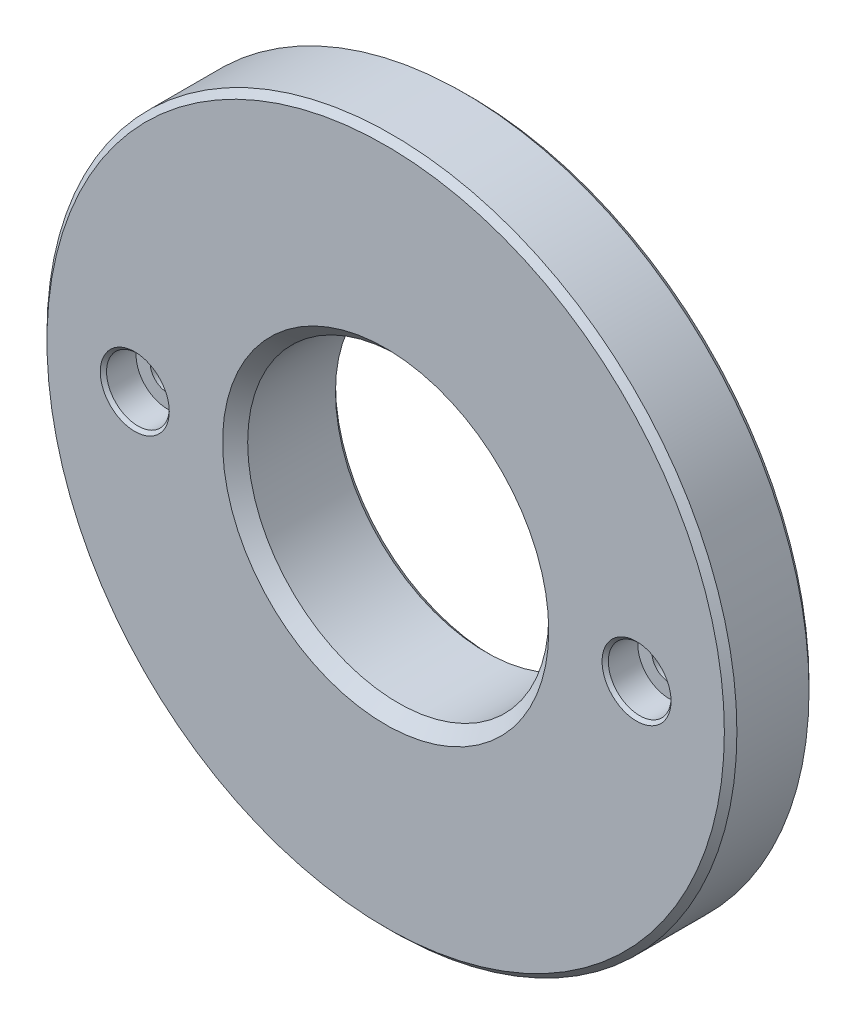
ISO-10303-21;
HEADER;
FILE_DESCRIPTION(('STEP AP214'),'2;1');
FILE_NAME('part.step','',(''),(''),'','','');
FILE_SCHEMA(('AUTOMOTIVE_DESIGN { 1 0 10303 214 1 1 1 1 }'));
ENDSEC;
DATA;
#1=APPLICATION_CONTEXT('core data for automotive mechanical design processes');
#2=APPLICATION_PROTOCOL_DEFINITION('international standard','automotive_design',2000,#1);
#3=PRODUCT_CONTEXT('',#1,'mechanical');
#4=PRODUCT('Part','Part','',(#3));
#5=PRODUCT_RELATED_PRODUCT_CATEGORY('part','',(#4));
#6=PRODUCT_DEFINITION_FORMATION('','',#4);
#7=PRODUCT_DEFINITION_CONTEXT('part definition',#1,'design');
#8=PRODUCT_DEFINITION('design','',#6,#7);
#9=PRODUCT_DEFINITION_SHAPE('','',#8);
#10=(LENGTH_UNIT() NAMED_UNIT(*) SI_UNIT(.MILLI.,.METRE.));
#11=(NAMED_UNIT(*) PLANE_ANGLE_UNIT() SI_UNIT($,.RADIAN.));
#12=(NAMED_UNIT(*) SI_UNIT($,.STERADIAN.) SOLID_ANGLE_UNIT());
#13=UNCERTAINTY_MEASURE_WITH_UNIT(LENGTH_MEASURE(1.E-05),#10,'distance_accuracy_value','');
#14=(GEOMETRIC_REPRESENTATION_CONTEXT(3) GLOBAL_UNCERTAINTY_ASSIGNED_CONTEXT((#13)) GLOBAL_UNIT_ASSIGNED_CONTEXT((#10,
#11,#12)) REPRESENTATION_CONTEXT('',''));
#15=CARTESIAN_POINT('',(0.,0.,0.));
#16=DIRECTION('',(0.,0.,1.));
#17=DIRECTION('',(1.,0.,0.));
#18=AXIS2_PLACEMENT_3D('',#15,#16,#17);
#19=CARTESIAN_POINT('',(0.,0.,-13.5));
#20=DIRECTION('',(0.,0.,0.999999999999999));
#21=DIRECTION('',(1.,0.,0.));
#22=AXIS2_PLACEMENT_3D('',#19,#20,#21);
#23=PLANE('',#22);
#24=CARTESIAN_POINT('',(0.,0.,-13.5));
#25=DIRECTION('',(0.,0.,0.999999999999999));
#26=DIRECTION('',(1.,0.,0.));
#27=AXIS2_PLACEMENT_3D('',#24,#25,#26);
#28=CIRCLE('',#27,54.);
#29=CARTESIAN_POINT('',(54.,0.,-13.5));
#30=VERTEX_POINT('',#29);
#31=EDGE_CURVE('E93',#30,#30,#28,.F.);
#32=ORIENTED_EDGE('',*,*,#31,.T.);
#33=EDGE_LOOP('',(#32));
#34=FACE_BOUND('',#33,.T.);
#35=CARTESIAN_POINT('',(0.,0.,-13.5));
#36=DIRECTION('',(0.,0.,0.999999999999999));
#37=DIRECTION('',(1.,0.,0.));
#38=AXIS2_PLACEMENT_3D('',#35,#36,#37);
#39=CIRCLE('',#38,45.);
#40=CARTESIAN_POINT('',(45.,0.,-13.5));
#41=VERTEX_POINT('',#40);
#42=EDGE_CURVE('E89',#41,#41,#39,.F.);
#43=ORIENTED_EDGE('',*,*,#42,.F.);
#44=EDGE_LOOP('',(#43));
#45=FACE_BOUND('',#44,.T.);
#46=ADVANCED_FACE('F38',(#34,#45),#23,.F.);
#47=CARTESIAN_POINT('',(0.,0.,-13.5));
#48=DIRECTION('',(0.,0.,0.999999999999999));
#49=DIRECTION('',(1.,0.,0.));
#50=AXIS2_PLACEMENT_3D('',#47,#48,#49);
#51=CYLINDRICAL_SURFACE('',#50,55.);
#52=CARTESIAN_POINT('',(0.,0.,-12.5));
#53=DIRECTION('',(0.,0.,0.999999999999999));
#54=DIRECTION('',(1.,0.,0.));
#55=AXIS2_PLACEMENT_3D('',#52,#53,#54);
#56=CIRCLE('',#55,55.);
#57=CARTESIAN_POINT('',(55.,0.,-12.5));
#58=VERTEX_POINT('',#57);
#59=EDGE_CURVE('E97',#58,#58,#56,.T.);
#60=CARTESIAN_POINT('',(0.,0.,-0.999999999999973));
#61=DIRECTION('',(0.,0.,0.999999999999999));
#62=DIRECTION('',(1.,0.,0.));
#63=AXIS2_PLACEMENT_3D('',#60,#61,#62);
#64=CIRCLE('',#63,55.);
#65=CARTESIAN_POINT('',(55.,0.,-0.999999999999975));
#66=VERTEX_POINT('',#65);
#67=EDGE_CURVE('E101',#66,#66,#64,.F.);
#68=CARTESIAN_POINT('',(55.,0.,-12.5));
#69=CARTESIAN_POINT('',(55.,0.,-12.3802083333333));
#70=CARTESIAN_POINT('',(55.,0.,-12.2604166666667));
#71=CARTESIAN_POINT('',(55.,0.,-12.0208333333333));
#72=CARTESIAN_POINT('',(55.,0.,-11.9010416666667));
#73=CARTESIAN_POINT('',(55.,0.,-11.6614583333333));
#74=CARTESIAN_POINT('',(55.,0.,-11.5416666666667));
#75=CARTESIAN_POINT('',(55.,0.,-11.3020833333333));
#76=CARTESIAN_POINT('',(55.,0.,-11.1822916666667));
#77=CARTESIAN_POINT('',(55.,0.,-10.9427083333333));
#78=CARTESIAN_POINT('',(55.,0.,-10.8229166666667));
#79=CARTESIAN_POINT('',(55.,0.,-10.5833333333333));
#80=CARTESIAN_POINT('',(55.,0.,-10.4635416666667));
#81=CARTESIAN_POINT('',(55.,0.,-10.2239583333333));
#82=CARTESIAN_POINT('',(55.,0.,-10.1041666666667));
#83=CARTESIAN_POINT('',(55.,0.,-9.86458333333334));
#84=CARTESIAN_POINT('',(55.,0.,-9.74479166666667));
#85=CARTESIAN_POINT('',(55.,0.,-9.50520833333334));
#86=CARTESIAN_POINT('',(55.,0.,-9.38541666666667));
#87=CARTESIAN_POINT('',(55.,0.,-9.14583333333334));
#88=CARTESIAN_POINT('',(55.,0.,-9.02604166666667));
#89=CARTESIAN_POINT('',(55.,0.,-8.78645833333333));
#90=CARTESIAN_POINT('',(55.,0.,-8.66666666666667));
#91=CARTESIAN_POINT('',(55.,0.,-8.42708333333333));
#92=CARTESIAN_POINT('',(55.,0.,-8.30729166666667));
#93=CARTESIAN_POINT('',(55.,0.,-8.06770833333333));
#94=CARTESIAN_POINT('',(55.,0.,-7.94791666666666));
#95=CARTESIAN_POINT('',(55.,0.,-7.70833333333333));
#96=CARTESIAN_POINT('',(55.,0.,-7.58854166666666));
#97=CARTESIAN_POINT('',(55.,0.,-7.34895833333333));
#98=CARTESIAN_POINT('',(55.,0.,-7.22916666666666));
#99=CARTESIAN_POINT('',(55.,0.,-6.98958333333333));
#100=CARTESIAN_POINT('',(55.,0.,-6.86979166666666));
#101=CARTESIAN_POINT('',(55.,0.,-6.63020833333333));
#102=CARTESIAN_POINT('',(55.,0.,-6.51041666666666));
#103=CARTESIAN_POINT('',(55.,0.,-6.27083333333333));
#104=CARTESIAN_POINT('',(55.,0.,-6.15104166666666));
#105=CARTESIAN_POINT('',(55.,0.,-5.91145833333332));
#106=CARTESIAN_POINT('',(55.,0.,-5.79166666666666));
#107=CARTESIAN_POINT('',(55.,0.,-5.55208333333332));
#108=CARTESIAN_POINT('',(55.,0.,-5.43229166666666));
#109=CARTESIAN_POINT('',(55.,0.,-5.19270833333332));
#110=CARTESIAN_POINT('',(55.,0.,-5.07291666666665));
#111=CARTESIAN_POINT('',(55.,0.,-4.83333333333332));
#112=CARTESIAN_POINT('',(55.,0.,-4.71354166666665));
#113=CARTESIAN_POINT('',(55.,0.,-4.47395833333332));
#114=CARTESIAN_POINT('',(55.,0.,-4.35416666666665));
#115=CARTESIAN_POINT('',(55.,0.,-4.11458333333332));
#116=CARTESIAN_POINT('',(55.,0.,-3.99479166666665));
#117=CARTESIAN_POINT('',(55.,0.,-3.75520833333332));
#118=CARTESIAN_POINT('',(55.,0.,-3.63541666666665));
#119=CARTESIAN_POINT('',(55.,0.,-3.39583333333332));
#120=CARTESIAN_POINT('',(55.,0.,-3.27604166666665));
#121=CARTESIAN_POINT('',(55.,0.,-3.03645833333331));
#122=CARTESIAN_POINT('',(55.,0.,-2.91666666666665));
#123=CARTESIAN_POINT('',(55.,0.,-2.67708333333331));
#124=CARTESIAN_POINT('',(55.,0.,-2.55729166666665));
#125=CARTESIAN_POINT('',(55.,0.,-2.31770833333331));
#126=CARTESIAN_POINT('',(55.,0.,-2.19791666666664));
#127=CARTESIAN_POINT('',(55.,0.,-1.95833333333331));
#128=CARTESIAN_POINT('',(55.,0.,-1.83854166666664));
#129=CARTESIAN_POINT('',(55.,0.,-1.59895833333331));
#130=CARTESIAN_POINT('',(55.,0.,-1.47916666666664));
#131=CARTESIAN_POINT('',(55.,0.,-1.23958333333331));
#132=CARTESIAN_POINT('',(55.,0.,-1.11979166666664));
#133=CARTESIAN_POINT('',(55.,0.,-0.999999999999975));
#134=B_SPLINE_CURVE_WITH_KNOTS('',3,(#68,#69,#70,#71,#72,#73,#74,#75,#76,#77,#78,#79,#80,#81,
#82,#83,#84,#85,#86,#87,#88,#89,#90,#91,#92,#93,#94,#95,#96,#97,#98,#99,#100,#101,#102,#103,
#104,#105,#106,#107,#108,#109,#110,#111,#112,#113,#114,#115,#116,#117,#118,#119,#120,#121,#122,
#123,#124,#125,#126,#127,#128,#129,#130,#131,#132,#133),.UNSPECIFIED.,.F.,.F.,(4,2,2,2,2,2,2,2,
2,2,2,2,2,2,2,2,2,2,2,2,2,2,2,2,2,2,2,2,2,2,2,2,4),(0.,0.359375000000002,0.718750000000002,
1.078125,1.4375,1.79687500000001,2.15625000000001,2.51562500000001,2.87500000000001,
3.23437500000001,3.59375000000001,3.95312500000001,4.31250000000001,4.67187500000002,
5.03125000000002,5.39062500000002,5.75000000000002,6.10937500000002,6.46875000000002,
6.82812500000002,7.18750000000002,7.54687500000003,7.90625000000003,8.26562500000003,
8.62500000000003,8.98437500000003,9.34375000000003,9.70312500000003,10.0625,10.421875,10.78125,
11.140625,11.5),.UNSPECIFIED.);
#135=EDGE_CURVE('BSEAM149',#58,#66,#134,.T.);
#136=ORIENTED_EDGE('',*,*,#59,.T.);
#137=ORIENTED_EDGE('',*,*,#67,.T.);
#138=ORIENTED_EDGE('',*,*,#135,.T.);
#139=ORIENTED_EDGE('',*,*,#135,.F.);
#140=EDGE_LOOP('',(#136,#138,#137,#139));
#141=FACE_BOUND('',#140,.T.);
#142=ADVANCED_FACE('F149',(#141),#51,.T.);
#143=CARTESIAN_POINT('',(0.,0.,0.));
#144=DIRECTION('',(0.,0.,0.999999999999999));
#145=DIRECTION('',(1.,0.,0.));
#146=AXIS2_PLACEMENT_3D('',#143,#144,#145);
#147=PLANE('',#146);
#148=CARTESIAN_POINT('',(-40.,0.,0.));
#149=DIRECTION('',(0.,0.,0.999999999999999));
#150=DIRECTION('',(1.,0.,0.));
#151=AXIS2_PLACEMENT_3D('',#148,#149,#150);
#152=CIRCLE('',#151,5.49999999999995);
#153=CARTESIAN_POINT('',(-34.5000000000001,0.,0.));
#154=VERTEX_POINT('',#153);
#155=EDGE_CURVE('E46',#154,#154,#152,.F.);
#156=ORIENTED_EDGE('',*,*,#155,.T.);
#157=EDGE_LOOP('',(#156));
#158=FACE_BOUND('',#157,.T.);
#159=CARTESIAN_POINT('',(40.,0.,0.));
#160=DIRECTION('',(0.,0.,0.999999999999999));
#161=DIRECTION('',(1.,0.,0.));
#162=AXIS2_PLACEMENT_3D('',#159,#160,#161);
#163=CIRCLE('',#162,5.49999999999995);
#164=CARTESIAN_POINT('',(45.4999999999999,0.,0.));
#165=VERTEX_POINT('',#164);
#166=EDGE_CURVE('E53',#165,#165,#163,.F.);
#167=ORIENTED_EDGE('',*,*,#166,.T.);
#168=EDGE_LOOP('',(#167));
#169=FACE_BOUND('',#168,.T.);
#170=CARTESIAN_POINT('',(0.,0.,0.));
#171=DIRECTION('',(0.,0.,0.999999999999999));
#172=DIRECTION('',(1.,0.,0.));
#173=AXIS2_PLACEMENT_3D('',#170,#171,#172);
#174=CIRCLE('',#173,26.);
#175=CARTESIAN_POINT('',(26.,0.,0.));
#176=VERTEX_POINT('',#175);
#177=EDGE_CURVE('E73',#176,#176,#174,.F.);
#178=ORIENTED_EDGE('',*,*,#177,.T.);
#179=EDGE_LOOP('',(#178));
#180=FACE_BOUND('',#179,.T.);
#181=CARTESIAN_POINT('',(0.,0.,0.));
#182=DIRECTION('',(0.,0.,0.999999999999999));
#183=DIRECTION('',(1.,0.,0.));
#184=AXIS2_PLACEMENT_3D('',#181,#182,#183);
#185=CIRCLE('',#184,54.);
#186=CARTESIAN_POINT('',(54.,0.,0.));
#187=VERTEX_POINT('',#186);
#188=EDGE_CURVE('E104',#187,#187,#185,.T.);
#189=ORIENTED_EDGE('',*,*,#188,.T.);
#190=EDGE_LOOP('',(#189));
#191=FACE_BOUND('',#190,.T.);
#192=ADVANCED_FACE('F155',(#158,#169,#180,#191),#147,.T.);
#193=CARTESIAN_POINT('',(0.,0.,0.));
#194=DIRECTION('',(0.,0.,-0.999999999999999));
#195=DIRECTION('',(-1.,0.,0.));
#196=AXIS2_PLACEMENT_3D('',#193,#194,#195);
#197=CONICAL_SURFACE('',#196,54.,0.785398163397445);
#198=ORIENTED_EDGE('',*,*,#67,.F.);
#199=EDGE_LOOP('',(#198));
#200=FACE_BOUND('',#199,.T.);
#201=ORIENTED_EDGE('',*,*,#188,.F.);
#202=EDGE_LOOP('',(#201));
#203=FACE_BOUND('',#202,.T.);
#204=ADVANCED_FACE('F164',(#200,#203),#197,.T.);
#205=CARTESIAN_POINT('',(0.,0.,-12.5));
#206=DIRECTION('',(0.,0.,0.999999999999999));
#207=DIRECTION('',(1.,0.,0.));
#208=AXIS2_PLACEMENT_3D('',#205,#206,#207);
#209=CONICAL_SURFACE('',#208,55.,0.785398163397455);
#210=CARTESIAN_POINT('',(54.,0.,-13.5));
#211=CARTESIAN_POINT('',(54.0104166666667,0.,-13.4895833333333));
#212=CARTESIAN_POINT('',(54.0208333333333,0.,-13.4791666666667));
#213=CARTESIAN_POINT('',(54.0416666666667,0.,-13.4583333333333));
#214=CARTESIAN_POINT('',(54.0520833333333,0.,-13.4479166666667));
#215=CARTESIAN_POINT('',(54.0729166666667,0.,-13.4270833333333));
#216=CARTESIAN_POINT('',(54.0833333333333,0.,-13.4166666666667));
#217=CARTESIAN_POINT('',(54.1041666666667,0.,-13.3958333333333));
#218=CARTESIAN_POINT('',(54.1145833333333,0.,-13.3854166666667));
#219=CARTESIAN_POINT('',(54.1354166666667,0.,-13.3645833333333));
#220=CARTESIAN_POINT('',(54.1458333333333,0.,-13.3541666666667));
#221=CARTESIAN_POINT('',(54.1666666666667,0.,-13.3333333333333));
#222=CARTESIAN_POINT('',(54.1770833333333,0.,-13.3229166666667));
#223=CARTESIAN_POINT('',(54.1979166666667,0.,-13.3020833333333));
#224=CARTESIAN_POINT('',(54.2083333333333,0.,-13.2916666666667));
#225=CARTESIAN_POINT('',(54.2291666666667,0.,-13.2708333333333));
#226=CARTESIAN_POINT('',(54.2395833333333,0.,-13.2604166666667));
#227=CARTESIAN_POINT('',(54.2604166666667,0.,-13.2395833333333));
#228=CARTESIAN_POINT('',(54.2708333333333,0.,-13.2291666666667));
#229=CARTESIAN_POINT('',(54.2916666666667,0.,-13.2083333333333));
#230=CARTESIAN_POINT('',(54.3020833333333,0.,-13.1979166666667));
#231=CARTESIAN_POINT('',(54.3229166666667,0.,-13.1770833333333));
#232=CARTESIAN_POINT('',(54.3333333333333,0.,-13.1666666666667));
#233=CARTESIAN_POINT('',(54.3541666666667,0.,-13.1458333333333));
#234=CARTESIAN_POINT('',(54.3645833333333,0.,-13.1354166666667));
#235=CARTESIAN_POINT('',(54.3854166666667,0.,-13.1145833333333));
#236=CARTESIAN_POINT('',(54.3958333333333,0.,-13.1041666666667));
#237=CARTESIAN_POINT('',(54.4166666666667,0.,-13.0833333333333));
#238=CARTESIAN_POINT('',(54.4270833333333,0.,-13.0729166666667));
#239=CARTESIAN_POINT('',(54.4479166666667,0.,-13.0520833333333));
#240=CARTESIAN_POINT('',(54.4583333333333,0.,-13.0416666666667));
#241=CARTESIAN_POINT('',(54.4791666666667,0.,-13.0208333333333));
#242=CARTESIAN_POINT('',(54.4895833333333,0.,-13.0104166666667));
#243=CARTESIAN_POINT('',(54.5104166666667,0.,-12.9895833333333));
#244=CARTESIAN_POINT('',(54.5208333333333,0.,-12.9791666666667));
#245=CARTESIAN_POINT('',(54.5416666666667,0.,-12.9583333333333));
#246=CARTESIAN_POINT('',(54.5520833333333,0.,-12.9479166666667));
#247=CARTESIAN_POINT('',(54.5729166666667,0.,-12.9270833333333));
#248=CARTESIAN_POINT('',(54.5833333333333,0.,-12.9166666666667));
#249=CARTESIAN_POINT('',(54.6041666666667,0.,-12.8958333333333));
#250=CARTESIAN_POINT('',(54.6145833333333,0.,-12.8854166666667));
#251=CARTESIAN_POINT('',(54.6354166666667,0.,-12.8645833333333));
#252=CARTESIAN_POINT('',(54.6458333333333,0.,-12.8541666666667));
#253=CARTESIAN_POINT('',(54.6666666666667,0.,-12.8333333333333));
#254=CARTESIAN_POINT('',(54.6770833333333,0.,-12.8229166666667));
#255=CARTESIAN_POINT('',(54.6979166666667,0.,-12.8020833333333));
#256=CARTESIAN_POINT('',(54.7083333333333,0.,-12.7916666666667));
#257=CARTESIAN_POINT('',(54.7291666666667,0.,-12.7708333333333));
#258=CARTESIAN_POINT('',(54.7395833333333,0.,-12.7604166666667));
#259=CARTESIAN_POINT('',(54.7604166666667,0.,-12.7395833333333));
#260=CARTESIAN_POINT('',(54.7708333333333,0.,-12.7291666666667));
#261=CARTESIAN_POINT('',(54.7916666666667,0.,-12.7083333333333));
#262=CARTESIAN_POINT('',(54.8020833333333,0.,-12.6979166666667));
#263=CARTESIAN_POINT('',(54.8229166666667,0.,-12.6770833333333));
#264=CARTESIAN_POINT('',(54.8333333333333,0.,-12.6666666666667));
#265=CARTESIAN_POINT('',(54.8541666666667,0.,-12.6458333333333));
#266=CARTESIAN_POINT('',(54.8645833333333,0.,-12.6354166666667));
#267=CARTESIAN_POINT('',(54.8854166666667,0.,-12.6145833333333));
#268=CARTESIAN_POINT('',(54.8958333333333,0.,-12.6041666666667));
#269=CARTESIAN_POINT('',(54.9166666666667,0.,-12.5833333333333));
#270=CARTESIAN_POINT('',(54.9270833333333,0.,-12.5729166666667));
#271=CARTESIAN_POINT('',(54.9479166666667,0.,-12.5520833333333));
#272=CARTESIAN_POINT('',(54.9583333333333,0.,-12.5416666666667));
#273=CARTESIAN_POINT('',(54.9791666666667,0.,-12.5208333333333));
#274=CARTESIAN_POINT('',(54.9895833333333,0.,-12.5104166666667));
#275=CARTESIAN_POINT('',(55.,0.,-12.5));
#276=B_SPLINE_CURVE_WITH_KNOTS('',3,(#210,#211,#212,#213,#214,#215,#216,#217,#218,#219,#220,
#221,#222,#223,#224,#225,#226,#227,#228,#229,#230,#231,#232,#233,#234,#235,#236,#237,#238,#239,
#240,#241,#242,#243,#244,#245,#246,#247,#248,#249,#250,#251,#252,#253,#254,#255,#256,#257,#258,
#259,#260,#261,#262,#263,#264,#265,#266,#267,#268,#269,#270,#271,#272,#273,#274,#275),
.UNSPECIFIED.,.F.,.F.,(4,2,2,2,2,2,2,2,2,2,2,2,2,2,2,2,2,2,2,2,2,2,2,2,2,2,2,2,2,2,2,2,4),(0.,
0.0441941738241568,0.0883883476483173,0.132582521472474,0.176776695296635,0.220970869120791,
0.265165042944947,0.309359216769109,0.353553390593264,0.397747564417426,0.441941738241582,
0.486135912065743,0.530330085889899,0.574524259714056,0.618718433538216,0.662912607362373,
0.707106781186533,0.75130095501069,0.795495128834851,0.839689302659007,0.883883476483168,
0.928077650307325,0.97227182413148,1.01646599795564,1.0606601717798,1.10485434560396,
1.14904851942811,1.19324269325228,1.23743686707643,1.28163104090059,1.32582521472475,
1.37001938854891,1.41421356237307),.UNSPECIFIED.);
#277=EDGE_CURVE('BSEAM168',#30,#58,#276,.T.);
#278=ORIENTED_EDGE('',*,*,#31,.F.);
#279=ORIENTED_EDGE('',*,*,#59,.F.);
#280=ORIENTED_EDGE('',*,*,#277,.T.);
#281=ORIENTED_EDGE('',*,*,#277,.F.);
#282=EDGE_LOOP('',(#278,#280,#279,#281));
#283=FACE_BOUND('',#282,.T.);
#284=ADVANCED_FACE('F168',(#283),#209,.T.);
#285=CARTESIAN_POINT('',(-40.,0.,-5.19999999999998));
#286=DIRECTION('',(0.,0.,0.999999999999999));
#287=DIRECTION('',(1.,0.,0.));
#288=AXIS2_PLACEMENT_3D('',#285,#286,#287);
#289=CYLINDRICAL_SURFACE('',#288,5.);
#290=CARTESIAN_POINT('',(-40.,0.,-0.499999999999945));
#291=DIRECTION('',(0.,0.,0.999999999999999));
#292=DIRECTION('',(1.,0.,0.));
#293=AXIS2_PLACEMENT_3D('',#290,#291,#292);
#294=CIRCLE('',#293,5.);
#295=CARTESIAN_POINT('',(-35.,0.,-0.499999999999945));
#296=VERTEX_POINT('',#295);
#297=EDGE_CURVE('E60',#296,#296,#294,.T.);
#298=CARTESIAN_POINT('',(-40.,0.,-5.19999999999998));
#299=DIRECTION('',(0.,0.,0.999999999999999));
#300=DIRECTION('',(1.,0.,0.));
#301=AXIS2_PLACEMENT_3D('',#298,#299,#300);
#302=CIRCLE('',#301,5.);
#303=CARTESIAN_POINT('',(-35.,0.,-5.19999999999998));
#304=VERTEX_POINT('',#303);
#305=EDGE_CURVE('E108',#304,#304,#302,.T.);
#306=CARTESIAN_POINT('',(-35.,0.,-0.499999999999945));
#307=CARTESIAN_POINT('',(-35.,0.,-0.548958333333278));
#308=CARTESIAN_POINT('',(-35.,0.,-0.597916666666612));
#309=CARTESIAN_POINT('',(-35.,0.,-0.695833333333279));
#310=CARTESIAN_POINT('',(-35.,0.,-0.744791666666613));
#311=CARTESIAN_POINT('',(-35.,0.,-0.84270833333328));
#312=CARTESIAN_POINT('',(-35.,0.,-0.891666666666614));
#313=CARTESIAN_POINT('',(-35.,0.,-0.989583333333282));
#314=CARTESIAN_POINT('',(-35.,0.,-1.03854166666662));
#315=CARTESIAN_POINT('',(-35.,0.,-1.13645833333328));
#316=CARTESIAN_POINT('',(-35.,0.,-1.18541666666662));
#317=CARTESIAN_POINT('',(-35.,0.,-1.28333333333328));
#318=CARTESIAN_POINT('',(-35.,0.,-1.33229166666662));
#319=CARTESIAN_POINT('',(-35.,0.,-1.43020833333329));
#320=CARTESIAN_POINT('',(-35.,0.,-1.47916666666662));
#321=CARTESIAN_POINT('',(-35.,0.,-1.57708333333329));
#322=CARTESIAN_POINT('',(-35.,0.,-1.62604166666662));
#323=CARTESIAN_POINT('',(-35.,0.,-1.72395833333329));
#324=CARTESIAN_POINT('',(-35.,0.,-1.77291666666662));
#325=CARTESIAN_POINT('',(-35.,0.,-1.87083333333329));
#326=CARTESIAN_POINT('',(-35.,0.,-1.91979166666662));
#327=CARTESIAN_POINT('',(-35.,0.,-2.01770833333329));
#328=CARTESIAN_POINT('',(-35.,0.,-2.06666666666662));
#329=CARTESIAN_POINT('',(-35.,0.,-2.16458333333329));
#330=CARTESIAN_POINT('',(-35.,0.,-2.21354166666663));
#331=CARTESIAN_POINT('',(-35.,0.,-2.31145833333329));
#332=CARTESIAN_POINT('',(-35.,0.,-2.36041666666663));
#333=CARTESIAN_POINT('',(-35.,0.,-2.45833333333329));
#334=CARTESIAN_POINT('',(-35.,0.,-2.50729166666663));
#335=CARTESIAN_POINT('',(-35.,0.,-2.6052083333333));
#336=CARTESIAN_POINT('',(-35.,0.,-2.65416666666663));
#337=CARTESIAN_POINT('',(-35.,0.,-2.7520833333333));
#338=CARTESIAN_POINT('',(-35.,0.,-2.80104166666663));
#339=CARTESIAN_POINT('',(-35.,0.,-2.8989583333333));
#340=CARTESIAN_POINT('',(-35.,0.,-2.94791666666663));
#341=CARTESIAN_POINT('',(-35.,0.,-3.0458333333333));
#342=CARTESIAN_POINT('',(-35.,0.,-3.09479166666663));
#343=CARTESIAN_POINT('',(-35.,0.,-3.1927083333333));
#344=CARTESIAN_POINT('',(-35.,0.,-3.24166666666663));
#345=CARTESIAN_POINT('',(-35.,0.,-3.3395833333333));
#346=CARTESIAN_POINT('',(-35.,0.,-3.38854166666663));
#347=CARTESIAN_POINT('',(-35.,0.,-3.4864583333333));
#348=CARTESIAN_POINT('',(-35.,0.,-3.53541666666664));
#349=CARTESIAN_POINT('',(-35.,0.,-3.6333333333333));
#350=CARTESIAN_POINT('',(-35.,0.,-3.68229166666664));
#351=CARTESIAN_POINT('',(-35.,0.,-3.7802083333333));
#352=CARTESIAN_POINT('',(-35.,0.,-3.82916666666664));
#353=CARTESIAN_POINT('',(-35.,0.,-3.92708333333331));
#354=CARTESIAN_POINT('',(-35.,0.,-3.97604166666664));
#355=CARTESIAN_POINT('',(-35.,0.,-4.07395833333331));
#356=CARTESIAN_POINT('',(-35.,0.,-4.12291666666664));
#357=CARTESIAN_POINT('',(-35.,0.,-4.22083333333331));
#358=CARTESIAN_POINT('',(-35.,0.,-4.26979166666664));
#359=CARTESIAN_POINT('',(-35.,0.,-4.36770833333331));
#360=CARTESIAN_POINT('',(-35.,0.,-4.41666666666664));
#361=CARTESIAN_POINT('',(-35.,0.,-4.51458333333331));
#362=CARTESIAN_POINT('',(-35.,0.,-4.56354166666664));
#363=CARTESIAN_POINT('',(-35.,0.,-4.66145833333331));
#364=CARTESIAN_POINT('',(-35.,0.,-4.71041666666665));
#365=CARTESIAN_POINT('',(-35.,0.,-4.80833333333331));
#366=CARTESIAN_POINT('',(-35.,0.,-4.85729166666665));
#367=CARTESIAN_POINT('',(-35.,0.,-4.95520833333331));
#368=CARTESIAN_POINT('',(-35.,0.,-5.00416666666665));
#369=CARTESIAN_POINT('',(-35.,0.,-5.10208333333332));
#370=CARTESIAN_POINT('',(-35.,0.,-5.15104166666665));
#371=CARTESIAN_POINT('',(-35.,0.,-5.19999999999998));
#372=B_SPLINE_CURVE_WITH_KNOTS('',3,(#306,#307,#308,#309,#310,#311,#312,#313,#314,#315,#316,
#317,#318,#319,#320,#321,#322,#323,#324,#325,#326,#327,#328,#329,#330,#331,#332,#333,#334,#335,
#336,#337,#338,#339,#340,#341,#342,#343,#344,#345,#346,#347,#348,#349,#350,#351,#352,#353,#354,
#355,#356,#357,#358,#359,#360,#361,#362,#363,#364,#365,#366,#367,#368,#369,#370,#371),
.UNSPECIFIED.,.F.,.F.,(4,2,2,2,2,2,2,2,2,2,2,2,2,2,2,2,2,2,2,2,2,2,2,2,2,2,2,2,2,2,2,2,4),(0.,
0.146875,0.293750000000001,0.440625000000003,0.587500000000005,0.734375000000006,
0.881250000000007,1.02812500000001,1.17500000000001,1.32187500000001,1.46875000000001,
1.61562500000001,1.76250000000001,1.90937500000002,2.05625000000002,2.20312500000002,
2.35000000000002,2.49687500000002,2.64375000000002,2.79062500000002,2.93750000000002,
3.08437500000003,3.23125000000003,3.37812500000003,3.52500000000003,3.67187500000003,
3.81875000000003,3.96562500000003,4.11250000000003,4.25937500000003,4.40625000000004,
4.55312500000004,4.70000000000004),.UNSPECIFIED.);
#373=EDGE_CURVE('BSEAM161',#296,#304,#372,.T.);
#374=ORIENTED_EDGE('',*,*,#297,.T.);
#375=ORIENTED_EDGE('',*,*,#305,.F.);
#376=ORIENTED_EDGE('',*,*,#373,.T.);
#377=ORIENTED_EDGE('',*,*,#373,.F.);
#378=EDGE_LOOP('',(#374,#376,#375,#377));
#379=FACE_BOUND('',#378,.T.);
#380=ADVANCED_FACE('F161',(#379),#289,.F.);
#381=CARTESIAN_POINT('',(-40.,0.,-5.19999999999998));
#382=DIRECTION('',(0.,0.,0.999999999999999));
#383=DIRECTION('',(1.,0.,0.));
#384=AXIS2_PLACEMENT_3D('',#381,#382,#383);
#385=PLANE('',#384);
#386=CARTESIAN_POINT('',(-40.,0.,-5.19999999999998));
#387=DIRECTION('',(0.,0.,0.999999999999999));
#388=DIRECTION('',(1.,0.,0.));
#389=AXIS2_PLACEMENT_3D('',#386,#387,#388);
#390=CIRCLE('',#389,2.75);
#391=CARTESIAN_POINT('',(-37.25,0.,-5.19999999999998));
#392=VERTEX_POINT('',#391);
#393=EDGE_CURVE('E114',#392,#392,#390,.T.);
#394=ORIENTED_EDGE('',*,*,#393,.F.);
#395=EDGE_LOOP('',(#394));
#396=FACE_BOUND('',#395,.T.);
#397=ORIENTED_EDGE('',*,*,#305,.T.);
#398=EDGE_LOOP('',(#397));
#399=FACE_BOUND('',#398,.T.);
#400=ADVANCED_FACE('F210',(#396,#399),#385,.T.);
#401=CARTESIAN_POINT('',(40.,0.,-5.19999999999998));
#402=DIRECTION('',(0.,0.,0.999999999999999));
#403=DIRECTION('',(1.,0.,0.));
#404=AXIS2_PLACEMENT_3D('',#401,#402,#403);
#405=CYLINDRICAL_SURFACE('',#404,5.);
#406=CARTESIAN_POINT('',(40.,0.,-0.499999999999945));
#407=DIRECTION('',(0.,0.,0.999999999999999));
#408=DIRECTION('',(1.,0.,0.));
#409=AXIS2_PLACEMENT_3D('',#406,#407,#408);
#410=CIRCLE('',#409,5.);
#411=CARTESIAN_POINT('',(45.,0.,-0.499999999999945));
#412=VERTEX_POINT('',#411);
#413=EDGE_CURVE('E10',#412,#412,#410,.T.);
#414=CARTESIAN_POINT('',(40.,0.,-5.19999999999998));
#415=DIRECTION('',(0.,0.,0.999999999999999));
#416=DIRECTION('',(1.,0.,0.));
#417=AXIS2_PLACEMENT_3D('',#414,#415,#416);
#418=CIRCLE('',#417,5.);
#419=CARTESIAN_POINT('',(45.,0.,-5.19999999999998));
#420=VERTEX_POINT('',#419);
#421=EDGE_CURVE('E111',#420,#420,#418,.T.);
#422=CARTESIAN_POINT('',(45.,0.,-0.499999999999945));
#423=CARTESIAN_POINT('',(45.,0.,-0.548958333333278));
#424=CARTESIAN_POINT('',(45.,0.,-0.597916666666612));
#425=CARTESIAN_POINT('',(45.,0.,-0.695833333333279));
#426=CARTESIAN_POINT('',(45.,0.,-0.744791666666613));
#427=CARTESIAN_POINT('',(45.,0.,-0.84270833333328));
#428=CARTESIAN_POINT('',(45.,0.,-0.891666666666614));
#429=CARTESIAN_POINT('',(45.,0.,-0.989583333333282));
#430=CARTESIAN_POINT('',(45.,0.,-1.03854166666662));
#431=CARTESIAN_POINT('',(45.,0.,-1.13645833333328));
#432=CARTESIAN_POINT('',(45.,0.,-1.18541666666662));
#433=CARTESIAN_POINT('',(45.,0.,-1.28333333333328));
#434=CARTESIAN_POINT('',(45.,0.,-1.33229166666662));
#435=CARTESIAN_POINT('',(45.,0.,-1.43020833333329));
#436=CARTESIAN_POINT('',(45.,0.,-1.47916666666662));
#437=CARTESIAN_POINT('',(45.,0.,-1.57708333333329));
#438=CARTESIAN_POINT('',(45.,0.,-1.62604166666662));
#439=CARTESIAN_POINT('',(45.,0.,-1.72395833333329));
#440=CARTESIAN_POINT('',(45.,0.,-1.77291666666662));
#441=CARTESIAN_POINT('',(45.,0.,-1.87083333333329));
#442=CARTESIAN_POINT('',(45.,0.,-1.91979166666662));
#443=CARTESIAN_POINT('',(45.,0.,-2.01770833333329));
#444=CARTESIAN_POINT('',(45.,0.,-2.06666666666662));
#445=CARTESIAN_POINT('',(45.,0.,-2.16458333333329));
#446=CARTESIAN_POINT('',(45.,0.,-2.21354166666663));
#447=CARTESIAN_POINT('',(45.,0.,-2.31145833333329));
#448=CARTESIAN_POINT('',(45.,0.,-2.36041666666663));
#449=CARTESIAN_POINT('',(45.,0.,-2.45833333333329));
#450=CARTESIAN_POINT('',(45.,0.,-2.50729166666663));
#451=CARTESIAN_POINT('',(45.,0.,-2.6052083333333));
#452=CARTESIAN_POINT('',(45.,0.,-2.65416666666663));
#453=CARTESIAN_POINT('',(45.,0.,-2.7520833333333));
#454=CARTESIAN_POINT('',(45.,0.,-2.80104166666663));
#455=CARTESIAN_POINT('',(45.,0.,-2.8989583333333));
#456=CARTESIAN_POINT('',(45.,0.,-2.94791666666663));
#457=CARTESIAN_POINT('',(45.,0.,-3.0458333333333));
#458=CARTESIAN_POINT('',(45.,0.,-3.09479166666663));
#459=CARTESIAN_POINT('',(45.,0.,-3.1927083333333));
#460=CARTESIAN_POINT('',(45.,0.,-3.24166666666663));
#461=CARTESIAN_POINT('',(45.,0.,-3.3395833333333));
#462=CARTESIAN_POINT('',(45.,0.,-3.38854166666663));
#463=CARTESIAN_POINT('',(45.,0.,-3.4864583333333));
#464=CARTESIAN_POINT('',(45.,0.,-3.53541666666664));
#465=CARTESIAN_POINT('',(45.,0.,-3.6333333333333));
#466=CARTESIAN_POINT('',(45.,0.,-3.68229166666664));
#467=CARTESIAN_POINT('',(45.,0.,-3.7802083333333));
#468=CARTESIAN_POINT('',(45.,0.,-3.82916666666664));
#469=CARTESIAN_POINT('',(45.,0.,-3.92708333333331));
#470=CARTESIAN_POINT('',(45.,0.,-3.97604166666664));
#471=CARTESIAN_POINT('',(45.,0.,-4.07395833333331));
#472=CARTESIAN_POINT('',(45.,0.,-4.12291666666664));
#473=CARTESIAN_POINT('',(45.,0.,-4.22083333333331));
#474=CARTESIAN_POINT('',(45.,0.,-4.26979166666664));
#475=CARTESIAN_POINT('',(45.,0.,-4.36770833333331));
#476=CARTESIAN_POINT('',(45.,0.,-4.41666666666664));
#477=CARTESIAN_POINT('',(45.,0.,-4.51458333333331));
#478=CARTESIAN_POINT('',(45.,0.,-4.56354166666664));
#479=CARTESIAN_POINT('',(45.,0.,-4.66145833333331));
#480=CARTESIAN_POINT('',(45.,0.,-4.71041666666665));
#481=CARTESIAN_POINT('',(45.,0.,-4.80833333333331));
#482=CARTESIAN_POINT('',(45.,0.,-4.85729166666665));
#483=CARTESIAN_POINT('',(45.,0.,-4.95520833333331));
#484=CARTESIAN_POINT('',(45.,0.,-5.00416666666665));
#485=CARTESIAN_POINT('',(45.,0.,-5.10208333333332));
#486=CARTESIAN_POINT('',(45.,0.,-5.15104166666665));
#487=CARTESIAN_POINT('',(45.,0.,-5.19999999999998));
#488=B_SPLINE_CURVE_WITH_KNOTS('',3,(#422,#423,#424,#425,#426,#427,#428,#429,#430,#431,#432,
#433,#434,#435,#436,#437,#438,#439,#440,#441,#442,#443,#444,#445,#446,#447,#448,#449,#450,#451,
#452,#453,#454,#455,#456,#457,#458,#459,#460,#461,#462,#463,#464,#465,#466,#467,#468,#469,#470,
#471,#472,#473,#474,#475,#476,#477,#478,#479,#480,#481,#482,#483,#484,#485,#486,#487),
.UNSPECIFIED.,.F.,.F.,(4,2,2,2,2,2,2,2,2,2,2,2,2,2,2,2,2,2,2,2,2,2,2,2,2,2,2,2,2,2,2,2,4),(0.,
0.146875,0.293750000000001,0.440625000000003,0.587500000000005,0.734375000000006,
0.881250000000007,1.02812500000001,1.17500000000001,1.32187500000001,1.46875000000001,
1.61562500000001,1.76250000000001,1.90937500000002,2.05625000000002,2.20312500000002,
2.35000000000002,2.49687500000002,2.64375000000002,2.79062500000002,2.93750000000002,
3.08437500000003,3.23125000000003,3.37812500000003,3.52500000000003,3.67187500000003,
3.81875000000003,3.96562500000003,4.11250000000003,4.25937500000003,4.40625000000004,
4.55312500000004,4.70000000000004),.UNSPECIFIED.);
#489=EDGE_CURVE('BSEAM207',#412,#420,#488,.T.);
#490=ORIENTED_EDGE('',*,*,#413,.T.);
#491=ORIENTED_EDGE('',*,*,#421,.F.);
#492=ORIENTED_EDGE('',*,*,#489,.T.);
#493=ORIENTED_EDGE('',*,*,#489,.F.);
#494=EDGE_LOOP('',(#490,#492,#491,#493));
#495=FACE_BOUND('',#494,.T.);
#496=ADVANCED_FACE('F207',(#495),#405,.F.);
#497=CARTESIAN_POINT('',(40.,0.,-5.19999999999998));
#498=DIRECTION('',(0.,0.,0.999999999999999));
#499=DIRECTION('',(1.,0.,0.));
#500=AXIS2_PLACEMENT_3D('',#497,#498,#499);
#501=PLANE('',#500);
#502=CARTESIAN_POINT('',(40.,0.,-5.19999999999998));
#503=DIRECTION('',(0.,0.,0.999999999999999));
#504=DIRECTION('',(1.,0.,0.));
#505=AXIS2_PLACEMENT_3D('',#502,#503,#504);
#506=CIRCLE('',#505,2.75);
#507=CARTESIAN_POINT('',(42.75,0.,-5.19999999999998));
#508=VERTEX_POINT('',#507);
#509=EDGE_CURVE('E122',#508,#508,#506,.T.);
#510=ORIENTED_EDGE('',*,*,#509,.F.);
#511=EDGE_LOOP('',(#510));
#512=FACE_BOUND('',#511,.T.);
#513=ORIENTED_EDGE('',*,*,#421,.T.);
#514=EDGE_LOOP('',(#513));
#515=FACE_BOUND('',#514,.T.);
#516=ADVANCED_FACE('F203',(#512,#515),#501,.T.);
#517=CARTESIAN_POINT('',(0.,0.,-17.));
#518=DIRECTION('',(0.,0.,0.999999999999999));
#519=DIRECTION('',(1.,0.,0.));
#520=AXIS2_PLACEMENT_3D('',#517,#518,#519);
#521=CYLINDRICAL_SURFACE('',#520,45.);
#522=CARTESIAN_POINT('',(0.,0.,-16.));
#523=DIRECTION('',(0.,0.,-0.999999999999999));
#524=DIRECTION('',(-1.,0.,0.));
#525=AXIS2_PLACEMENT_3D('',#522,#523,#524);
#526=CIRCLE('',#525,45.);
#527=CARTESIAN_POINT('',(45.,0.,-16.));
#528=VERTEX_POINT('',#527);
#529=EDGE_CURVE('E81',#528,#528,#526,.F.);
#530=CARTESIAN_POINT('',(45.,0.,-16.));
#531=CARTESIAN_POINT('',(45.,0.,-15.9739583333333));
#532=CARTESIAN_POINT('',(45.,0.,-15.9479166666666));
#533=CARTESIAN_POINT('',(45.,0.,-15.8958333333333));
#534=CARTESIAN_POINT('',(45.,0.,-15.8697916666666));
#535=CARTESIAN_POINT('',(45.,0.,-15.8177083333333));
#536=CARTESIAN_POINT('',(45.,0.,-15.7916666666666));
#537=CARTESIAN_POINT('',(45.,0.,-15.7395833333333));
#538=CARTESIAN_POINT('',(45.,0.,-15.7135416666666));
#539=CARTESIAN_POINT('',(45.,0.,-15.6614583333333));
#540=CARTESIAN_POINT('',(45.,0.,-15.6354166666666));
#541=CARTESIAN_POINT('',(45.,0.,-15.5833333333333));
#542=CARTESIAN_POINT('',(45.,0.,-15.5572916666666));
#543=CARTESIAN_POINT('',(45.,0.,-15.5052083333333));
#544=CARTESIAN_POINT('',(45.,0.,-15.4791666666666));
#545=CARTESIAN_POINT('',(45.,0.,-15.4270833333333));
#546=CARTESIAN_POINT('',(45.,0.,-15.4010416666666));
#547=CARTESIAN_POINT('',(45.,0.,-15.3489583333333));
#548=CARTESIAN_POINT('',(45.,0.,-15.3229166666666));
#549=CARTESIAN_POINT('',(45.,0.,-15.2708333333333));
#550=CARTESIAN_POINT('',(45.,0.,-15.2447916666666));
#551=CARTESIAN_POINT('',(45.,0.,-15.1927083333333));
#552=CARTESIAN_POINT('',(45.,0.,-15.1666666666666));
#553=CARTESIAN_POINT('',(45.,0.,-15.1145833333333));
#554=CARTESIAN_POINT('',(45.,0.,-15.0885416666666));
#555=CARTESIAN_POINT('',(45.,0.,-15.0364583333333));
#556=CARTESIAN_POINT('',(45.,0.,-15.0104166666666));
#557=CARTESIAN_POINT('',(45.,0.,-14.9583333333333));
#558=CARTESIAN_POINT('',(45.,0.,-14.9322916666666));
#559=CARTESIAN_POINT('',(45.,0.,-14.8802083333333));
#560=CARTESIAN_POINT('',(45.,0.,-14.8541666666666));
#561=CARTESIAN_POINT('',(45.,0.,-14.8020833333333));
#562=CARTESIAN_POINT('',(45.,0.,-14.7760416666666));
#563=CARTESIAN_POINT('',(45.,0.,-14.7239583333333));
#564=CARTESIAN_POINT('',(45.,0.,-14.6979166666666));
#565=CARTESIAN_POINT('',(45.,0.,-14.6458333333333));
#566=CARTESIAN_POINT('',(45.,0.,-14.6197916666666));
#567=CARTESIAN_POINT('',(45.,0.,-14.5677083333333));
#568=CARTESIAN_POINT('',(45.,0.,-14.5416666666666));
#569=CARTESIAN_POINT('',(45.,0.,-14.4895833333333));
#570=CARTESIAN_POINT('',(45.,0.,-14.4635416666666));
#571=CARTESIAN_POINT('',(45.,0.,-14.4114583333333));
#572=CARTESIAN_POINT('',(45.,0.,-14.3854166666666));
#573=CARTESIAN_POINT('',(45.,0.,-14.3333333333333));
#574=CARTESIAN_POINT('',(45.,0.,-14.3072916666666));
#575=CARTESIAN_POINT('',(45.,0.,-14.2552083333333));
#576=CARTESIAN_POINT('',(45.,0.,-14.2291666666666));
#577=CARTESIAN_POINT('',(45.,0.,-14.1770833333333));
#578=CARTESIAN_POINT('',(45.,0.,-14.1510416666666));
#579=CARTESIAN_POINT('',(45.,0.,-14.0989583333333));
#580=CARTESIAN_POINT('',(45.,0.,-14.0729166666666));
#581=CARTESIAN_POINT('',(45.,0.,-14.0208333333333));
#582=CARTESIAN_POINT('',(45.,0.,-13.9947916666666));
#583=CARTESIAN_POINT('',(45.,0.,-13.9427083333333));
#584=CARTESIAN_POINT('',(45.,0.,-13.9166666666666));
#585=CARTESIAN_POINT('',(45.,0.,-13.8645833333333));
#586=CARTESIAN_POINT('',(45.,0.,-13.8385416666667));
#587=CARTESIAN_POINT('',(45.,0.,-13.7864583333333));
#588=CARTESIAN_POINT('',(45.,0.,-13.7604166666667));
#589=CARTESIAN_POINT('',(45.,0.,-13.7083333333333));
#590=CARTESIAN_POINT('',(45.,0.,-13.6822916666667));
#591=CARTESIAN_POINT('',(45.,0.,-13.6302083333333));
#592=CARTESIAN_POINT('',(45.,0.,-13.6041666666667));
#593=CARTESIAN_POINT('',(45.,0.,-13.5520833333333));
#594=CARTESIAN_POINT('',(45.,0.,-13.5260416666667));
#595=CARTESIAN_POINT('',(45.,0.,-13.5));
#596=B_SPLINE_CURVE_WITH_KNOTS('',3,(#530,#531,#532,#533,#534,#535,#536,#537,#538,#539,#540,
#541,#542,#543,#544,#545,#546,#547,#548,#549,#550,#551,#552,#553,#554,#555,#556,#557,#558,#559,
#560,#561,#562,#563,#564,#565,#566,#567,#568,#569,#570,#571,#572,#573,#574,#575,#576,#577,#578,
#579,#580,#581,#582,#583,#584,#585,#586,#587,#588,#589,#590,#591,#592,#593,#594,#595),
.UNSPECIFIED.,.F.,.F.,(4,2,2,2,2,2,2,2,2,2,2,2,2,2,2,2,2,2,2,2,2,2,2,2,2,2,2,2,2,2,2,2,4),(0.,
0.0781250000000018,0.15625,0.234374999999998,0.312499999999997,0.390624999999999,
0.468749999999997,0.546874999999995,0.624999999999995,0.703124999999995,0.781249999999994,
0.859374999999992,0.937499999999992,1.01562499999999,1.09374999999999,1.17187499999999,
1.24999999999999,1.32812499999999,1.40624999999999,1.48437499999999,1.56249999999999,
1.64062499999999,1.71874999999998,1.79687499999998,1.87499999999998,1.95312499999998,
2.03124999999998,2.10937499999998,2.18749999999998,2.26562499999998,2.34374999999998,
2.42187499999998,2.49999999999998),.UNSPECIFIED.);
#597=EDGE_CURVE('BSEAM200',#528,#41,#596,.T.);
#598=ORIENTED_EDGE('',*,*,#529,.T.);
#599=ORIENTED_EDGE('',*,*,#42,.T.);
#600=ORIENTED_EDGE('',*,*,#597,.T.);
#601=ORIENTED_EDGE('',*,*,#597,.F.);
#602=EDGE_LOOP('',(#598,#600,#599,#601));
#603=FACE_BOUND('',#602,.T.);
#604=ADVANCED_FACE('F200',(#603),#521,.T.);
#605=CARTESIAN_POINT('',(0.,0.,-17.));
#606=DIRECTION('',(0.,0.,-0.999999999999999));
#607=DIRECTION('',(-1.,0.,0.));
#608=AXIS2_PLACEMENT_3D('',#605,#606,#607);
#609=PLANE('',#608);
#610=CARTESIAN_POINT('',(40.,0.,-17.));
#611=DIRECTION('',(0.,0.,0.999999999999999));
#612=DIRECTION('',(1.,0.,0.));
#613=AXIS2_PLACEMENT_3D('',#610,#611,#612);
#614=CIRCLE('',#613,2.75);
#615=CARTESIAN_POINT('',(42.75,0.,-17.));
#616=VERTEX_POINT('',#615);
#617=EDGE_CURVE('E126',#616,#616,#614,.T.);
#618=ORIENTED_EDGE('',*,*,#617,.T.);
#619=EDGE_LOOP('',(#618));
#620=FACE_BOUND('',#619,.T.);
#621=CARTESIAN_POINT('',(-40.,0.,-17.));
#622=DIRECTION('',(0.,0.,0.999999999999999));
#623=DIRECTION('',(1.,0.,0.));
#624=AXIS2_PLACEMENT_3D('',#621,#622,#623);
#625=CIRCLE('',#624,2.75);
#626=CARTESIAN_POINT('',(-37.25,0.,-17.));
#627=VERTEX_POINT('',#626);
#628=EDGE_CURVE('E118',#627,#627,#625,.T.);
#629=ORIENTED_EDGE('',*,*,#628,.T.);
#630=EDGE_LOOP('',(#629));
#631=FACE_BOUND('',#630,.T.);
#632=CARTESIAN_POINT('',(0.,0.,-17.));
#633=DIRECTION('',(0.,0.,-0.999999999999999));
#634=DIRECTION('',(-1.,0.,0.));
#635=AXIS2_PLACEMENT_3D('',#632,#633,#634);
#636=CIRCLE('',#635,25.);
#637=CARTESIAN_POINT('',(-25.,0.,-17.));
#638=VERTEX_POINT('',#637);
#639=EDGE_CURVE('E66',#638,#638,#636,.F.);
#640=ORIENTED_EDGE('',*,*,#639,.T.);
#641=EDGE_LOOP('',(#640));
#642=FACE_BOUND('',#641,.T.);
#643=CARTESIAN_POINT('',(0.,0.,-17.));
#644=DIRECTION('',(0.,0.,-0.999999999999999));
#645=DIRECTION('',(-1.,0.,0.));
#646=AXIS2_PLACEMENT_3D('',#643,#644,#645);
#647=CIRCLE('',#646,44.);
#648=CARTESIAN_POINT('',(44.,0.,-17.));
#649=VERTEX_POINT('',#648);
#650=EDGE_CURVE('E85',#649,#649,#647,.T.);
#651=ORIENTED_EDGE('',*,*,#650,.T.);
#652=EDGE_LOOP('',(#651));
#653=FACE_BOUND('',#652,.T.);
#654=ADVANCED_FACE('F131',(#620,#631,#642,#653),#609,.T.);
#655=CARTESIAN_POINT('',(0.,0.,-17.));
#656=DIRECTION('',(0.,0.,0.999999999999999));
#657=DIRECTION('',(1.,0.,0.));
#658=AXIS2_PLACEMENT_3D('',#655,#656,#657);
#659=CONICAL_SURFACE('',#658,44.,0.785398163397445);
#660=CARTESIAN_POINT('',(45.,0.,-16.));
#661=CARTESIAN_POINT('',(44.9895833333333,0.,-16.0104166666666));
#662=CARTESIAN_POINT('',(44.9791666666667,0.,-16.0208333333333));
#663=CARTESIAN_POINT('',(44.9583333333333,0.,-16.0416666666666));
#664=CARTESIAN_POINT('',(44.9479166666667,0.,-16.0520833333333));
#665=CARTESIAN_POINT('',(44.9270833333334,0.,-16.0729166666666));
#666=CARTESIAN_POINT('',(44.9166666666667,0.,-16.0833333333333));
#667=CARTESIAN_POINT('',(44.8958333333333,0.,-16.1041666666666));
#668=CARTESIAN_POINT('',(44.8854166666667,0.,-16.1145833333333));
#669=CARTESIAN_POINT('',(44.8645833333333,0.,-16.1354166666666));
#670=CARTESIAN_POINT('',(44.8541666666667,0.,-16.1458333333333));
#671=CARTESIAN_POINT('',(44.8333333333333,0.,-16.1666666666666));
#672=CARTESIAN_POINT('',(44.8229166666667,0.,-16.1770833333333));
#673=CARTESIAN_POINT('',(44.8020833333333,0.,-16.1979166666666));
#674=CARTESIAN_POINT('',(44.7916666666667,0.,-16.2083333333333));
#675=CARTESIAN_POINT('',(44.7708333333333,0.,-16.2291666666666));
#676=CARTESIAN_POINT('',(44.7604166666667,0.,-16.2395833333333));
#677=CARTESIAN_POINT('',(44.7395833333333,0.,-16.2604166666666));
#678=CARTESIAN_POINT('',(44.7291666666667,0.,-16.2708333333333));
#679=CARTESIAN_POINT('',(44.7083333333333,0.,-16.2916666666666));
#680=CARTESIAN_POINT('',(44.6979166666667,0.,-16.3020833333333));
#681=CARTESIAN_POINT('',(44.6770833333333,0.,-16.3229166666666));
#682=CARTESIAN_POINT('',(44.6666666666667,0.,-16.3333333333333));
#683=CARTESIAN_POINT('',(44.6458333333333,0.,-16.3541666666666));
#684=CARTESIAN_POINT('',(44.6354166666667,0.,-16.3645833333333));
#685=CARTESIAN_POINT('',(44.6145833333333,0.,-16.3854166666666));
#686=CARTESIAN_POINT('',(44.6041666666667,0.,-16.3958333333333));
#687=CARTESIAN_POINT('',(44.5833333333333,0.,-16.4166666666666));
#688=CARTESIAN_POINT('',(44.5729166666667,0.,-16.4270833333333));
#689=CARTESIAN_POINT('',(44.5520833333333,0.,-16.4479166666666));
#690=CARTESIAN_POINT('',(44.5416666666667,0.,-16.4583333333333));
#691=CARTESIAN_POINT('',(44.5208333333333,0.,-16.4791666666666));
#692=CARTESIAN_POINT('',(44.5104166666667,0.,-16.4895833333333));
#693=CARTESIAN_POINT('',(44.4895833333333,0.,-16.5104166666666));
#694=CARTESIAN_POINT('',(44.4791666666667,0.,-16.5208333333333));
#695=CARTESIAN_POINT('',(44.4583333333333,0.,-16.5416666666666));
#696=CARTESIAN_POINT('',(44.4479166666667,0.,-16.5520833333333));
#697=CARTESIAN_POINT('',(44.4270833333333,0.,-16.5729166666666));
#698=CARTESIAN_POINT('',(44.4166666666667,0.,-16.5833333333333));
#699=CARTESIAN_POINT('',(44.3958333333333,0.,-16.6041666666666));
#700=CARTESIAN_POINT('',(44.3854166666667,0.,-16.6145833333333));
#701=CARTESIAN_POINT('',(44.3645833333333,0.,-16.6354166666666));
#702=CARTESIAN_POINT('',(44.3541666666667,0.,-16.6458333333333));
#703=CARTESIAN_POINT('',(44.3333333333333,0.,-16.6666666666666));
#704=CARTESIAN_POINT('',(44.3229166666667,0.,-16.6770833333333));
#705=CARTESIAN_POINT('',(44.3020833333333,0.,-16.6979166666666));
#706=CARTESIAN_POINT('',(44.2916666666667,0.,-16.7083333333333));
#707=CARTESIAN_POINT('',(44.2708333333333,0.,-16.7291666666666));
#708=CARTESIAN_POINT('',(44.2604166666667,0.,-16.7395833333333));
#709=CARTESIAN_POINT('',(44.2395833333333,0.,-16.7604166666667));
#710=CARTESIAN_POINT('',(44.2291666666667,0.,-16.7708333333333));
#711=CARTESIAN_POINT('',(44.2083333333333,0.,-16.7916666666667));
#712=CARTESIAN_POINT('',(44.1979166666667,0.,-16.8020833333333));
#713=CARTESIAN_POINT('',(44.1770833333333,0.,-16.8229166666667));
#714=CARTESIAN_POINT('',(44.1666666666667,0.,-16.8333333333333));
#715=CARTESIAN_POINT('',(44.1458333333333,0.,-16.8541666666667));
#716=CARTESIAN_POINT('',(44.1354166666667,0.,-16.8645833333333));
#717=CARTESIAN_POINT('',(44.1145833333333,0.,-16.8854166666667));
#718=CARTESIAN_POINT('',(44.1041666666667,0.,-16.8958333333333));
#719=CARTESIAN_POINT('',(44.0833333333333,0.,-16.9166666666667));
#720=CARTESIAN_POINT('',(44.0729166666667,0.,-16.9270833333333));
#721=CARTESIAN_POINT('',(44.0520833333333,0.,-16.9479166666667));
#722=CARTESIAN_POINT('',(44.0416666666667,0.,-16.9583333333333));
#723=CARTESIAN_POINT('',(44.0208333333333,0.,-16.9791666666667));
#724=CARTESIAN_POINT('',(44.0104166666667,0.,-16.9895833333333));
#725=CARTESIAN_POINT('',(44.,0.,-17.));
#726=B_SPLINE_CURVE_WITH_KNOTS('',3,(#660,#661,#662,#663,#664,#665,#666,#667,#668,#669,#670,
#671,#672,#673,#674,#675,#676,#677,#678,#679,#680,#681,#682,#683,#684,#685,#686,#687,#688,#689,
#690,#691,#692,#693,#694,#695,#696,#697,#698,#699,#700,#701,#702,#703,#704,#705,#706,#707,#708,
#709,#710,#711,#712,#713,#714,#715,#716,#717,#718,#719,#720,#721,#722,#723,#724,#725),
.UNSPECIFIED.,.F.,.F.,(4,2,2,2,2,2,2,2,2,2,2,2,2,2,2,2,2,2,2,2,2,2,2,2,2,2,2,2,2,2,2,2,4),(0.,
0.0441941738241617,0.0883883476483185,0.13258252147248,0.176776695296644,0.220970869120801,
0.265165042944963,0.30935921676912,0.353553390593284,0.397747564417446,0.441941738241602,
0.486135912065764,0.530330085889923,0.574524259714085,0.618718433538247,0.662912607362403,
0.707106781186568,0.751300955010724,0.795495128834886,0.839689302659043,0.883883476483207,
0.928077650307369,0.972271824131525,1.01646599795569,1.06066017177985,1.10485434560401,
1.14904851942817,1.19324269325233,1.23743686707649,1.28163104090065,1.32582521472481,
1.37001938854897,1.41421356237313),.UNSPECIFIED.);
#727=EDGE_CURVE('BSEAM173',#528,#649,#726,.T.);
#728=ORIENTED_EDGE('',*,*,#529,.F.);
#729=ORIENTED_EDGE('',*,*,#650,.F.);
#730=ORIENTED_EDGE('',*,*,#727,.T.);
#731=ORIENTED_EDGE('',*,*,#727,.F.);
#732=EDGE_LOOP('',(#728,#730,#729,#731));
#733=FACE_BOUND('',#732,.T.);
#734=ADVANCED_FACE('F173',(#733),#659,.T.);
#735=CARTESIAN_POINT('',(0.,0.,-20.));
#736=DIRECTION('',(0.,0.,0.999999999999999));
#737=DIRECTION('',(1.,0.,0.));
#738=AXIS2_PLACEMENT_3D('',#735,#736,#737);
#739=CYLINDRICAL_SURFACE('',#738,24.);
#740=CARTESIAN_POINT('',(0.,0.,-16.));
#741=DIRECTION('',(0.,0.,-0.999999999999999));
#742=DIRECTION('',(-1.,0.,0.));
#743=AXIS2_PLACEMENT_3D('',#740,#741,#742);
#744=CIRCLE('',#743,24.);
#745=CARTESIAN_POINT('',(24.,0.,-16.));
#746=VERTEX_POINT('',#745);
#747=EDGE_CURVE('E69',#746,#746,#744,.T.);
#748=CARTESIAN_POINT('',(0.,0.,-1.99999999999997));
#749=DIRECTION('',(0.,0.,0.999999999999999));
#750=DIRECTION('',(1.,0.,0.));
#751=AXIS2_PLACEMENT_3D('',#748,#749,#750);
#752=CIRCLE('',#751,24.);
#753=CARTESIAN_POINT('',(24.,0.,-1.99999999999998));
#754=VERTEX_POINT('',#753);
#755=EDGE_CURVE('E77',#754,#754,#752,.T.);
#756=CARTESIAN_POINT('',(24.,0.,-16.));
#757=CARTESIAN_POINT('',(24.,0.,-15.8541666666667));
#758=CARTESIAN_POINT('',(24.,0.,-15.7083333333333));
#759=CARTESIAN_POINT('',(24.,0.,-15.4166666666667));
#760=CARTESIAN_POINT('',(24.,0.,-15.2708333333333));
#761=CARTESIAN_POINT('',(24.,0.,-14.9791666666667));
#762=CARTESIAN_POINT('',(24.,0.,-14.8333333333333));
#763=CARTESIAN_POINT('',(24.,0.,-14.5416666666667));
#764=CARTESIAN_POINT('',(24.,0.,-14.3958333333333));
#765=CARTESIAN_POINT('',(24.,0.,-14.1041666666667));
#766=CARTESIAN_POINT('',(24.,0.,-13.9583333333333));
#767=CARTESIAN_POINT('',(24.,0.,-13.6666666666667));
#768=CARTESIAN_POINT('',(24.,0.,-13.5208333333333));
#769=CARTESIAN_POINT('',(24.,0.,-13.2291666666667));
#770=CARTESIAN_POINT('',(24.,0.,-13.0833333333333));
#771=CARTESIAN_POINT('',(24.,0.,-12.7916666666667));
#772=CARTESIAN_POINT('',(24.,0.,-12.6458333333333));
#773=CARTESIAN_POINT('',(24.,0.,-12.3541666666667));
#774=CARTESIAN_POINT('',(24.,0.,-12.2083333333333));
#775=CARTESIAN_POINT('',(24.,0.,-11.9166666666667));
#776=CARTESIAN_POINT('',(24.,0.,-11.7708333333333));
#777=CARTESIAN_POINT('',(24.,0.,-11.4791666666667));
#778=CARTESIAN_POINT('',(24.,0.,-11.3333333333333));
#779=CARTESIAN_POINT('',(24.,0.,-11.0416666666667));
#780=CARTESIAN_POINT('',(24.,0.,-10.8958333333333));
#781=CARTESIAN_POINT('',(24.,0.,-10.6041666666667));
#782=CARTESIAN_POINT('',(24.,0.,-10.4583333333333));
#783=CARTESIAN_POINT('',(24.,0.,-10.1666666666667));
#784=CARTESIAN_POINT('',(24.,0.,-10.0208333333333));
#785=CARTESIAN_POINT('',(24.,0.,-9.72916666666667));
#786=CARTESIAN_POINT('',(24.,0.,-9.58333333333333));
#787=CARTESIAN_POINT('',(24.,0.,-9.29166666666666));
#788=CARTESIAN_POINT('',(24.,0.,-9.14583333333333));
#789=CARTESIAN_POINT('',(24.,0.,-8.85416666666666));
#790=CARTESIAN_POINT('',(24.,0.,-8.70833333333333));
#791=CARTESIAN_POINT('',(24.,0.,-8.41666666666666));
#792=CARTESIAN_POINT('',(24.,0.,-8.27083333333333));
#793=CARTESIAN_POINT('',(24.,0.,-7.97916666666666));
#794=CARTESIAN_POINT('',(24.,0.,-7.83333333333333));
#795=CARTESIAN_POINT('',(24.,0.,-7.54166666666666));
#796=CARTESIAN_POINT('',(24.,0.,-7.39583333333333));
#797=CARTESIAN_POINT('',(24.,0.,-7.10416666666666));
#798=CARTESIAN_POINT('',(24.,0.,-6.95833333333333));
#799=CARTESIAN_POINT('',(24.,0.,-6.66666666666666));
#800=CARTESIAN_POINT('',(24.,0.,-6.52083333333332));
#801=CARTESIAN_POINT('',(24.,0.,-6.22916666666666));
#802=CARTESIAN_POINT('',(24.,0.,-6.08333333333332));
#803=CARTESIAN_POINT('',(24.,0.,-5.79166666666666));
#804=CARTESIAN_POINT('',(24.,0.,-5.64583333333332));
#805=CARTESIAN_POINT('',(24.,0.,-5.35416666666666));
#806=CARTESIAN_POINT('',(24.,0.,-5.20833333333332));
#807=CARTESIAN_POINT('',(24.,0.,-4.91666666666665));
#808=CARTESIAN_POINT('',(24.,0.,-4.77083333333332));
#809=CARTESIAN_POINT('',(24.,0.,-4.47916666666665));
#810=CARTESIAN_POINT('',(24.,0.,-4.33333333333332));
#811=CARTESIAN_POINT('',(24.,0.,-4.04166666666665));
#812=CARTESIAN_POINT('',(24.,0.,-3.89583333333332));
#813=CARTESIAN_POINT('',(24.,0.,-3.60416666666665));
#814=CARTESIAN_POINT('',(24.,0.,-3.45833333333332));
#815=CARTESIAN_POINT('',(24.,0.,-3.16666666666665));
#816=CARTESIAN_POINT('',(24.,0.,-3.02083333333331));
#817=CARTESIAN_POINT('',(24.,0.,-2.72916666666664));
#818=CARTESIAN_POINT('',(24.,0.,-2.58333333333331));
#819=CARTESIAN_POINT('',(24.,0.,-2.29166666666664));
#820=CARTESIAN_POINT('',(24.,0.,-2.14583333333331));
#821=CARTESIAN_POINT('',(24.,0.,-1.99999999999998));
#822=B_SPLINE_CURVE_WITH_KNOTS('',3,(#756,#757,#758,#759,#760,#761,#762,#763,#764,#765,#766,
#767,#768,#769,#770,#771,#772,#773,#774,#775,#776,#777,#778,#779,#780,#781,#782,#783,#784,#785,
#786,#787,#788,#789,#790,#791,#792,#793,#794,#795,#796,#797,#798,#799,#800,#801,#802,#803,#804,
#805,#806,#807,#808,#809,#810,#811,#812,#813,#814,#815,#816,#817,#818,#819,#820,#821),
.UNSPECIFIED.,.F.,.F.,(4,2,2,2,2,2,2,2,2,2,2,2,2,2,2,2,2,2,2,2,2,2,2,2,2,2,2,2,2,2,2,2,4),(0.,
0.437500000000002,0.875000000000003,1.3125,1.75000000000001,2.18750000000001,2.62500000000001,
3.06250000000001,3.50000000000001,3.93750000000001,4.37500000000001,4.81250000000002,
5.25000000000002,5.68750000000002,6.12500000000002,6.56250000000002,7.00000000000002,
7.43750000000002,7.87500000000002,8.31250000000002,8.75000000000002,9.18750000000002,
9.62500000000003,10.0625,10.5,10.9375,11.375,11.8125,12.25,12.6875,13.125,13.5625,14.),.UNSPECIFIED.);
#823=EDGE_CURVE('BSEAM176',#746,#754,#822,.T.);
#824=ORIENTED_EDGE('',*,*,#747,.T.);
#825=ORIENTED_EDGE('',*,*,#755,.T.);
#826=ORIENTED_EDGE('',*,*,#823,.T.);
#827=ORIENTED_EDGE('',*,*,#823,.F.);
#828=EDGE_LOOP('',(#824,#826,#825,#827));
#829=FACE_BOUND('',#828,.T.);
#830=ADVANCED_FACE('F176',(#829),#739,.F.);
#831=CARTESIAN_POINT('',(0.,0.,-1.99999999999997));
#832=DIRECTION('',(0.,0.,0.999999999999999));
#833=DIRECTION('',(1.,0.,0.));
#834=AXIS2_PLACEMENT_3D('',#831,#832,#833);
#835=CONICAL_SURFACE('',#834,24.,0.785398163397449);
#836=CARTESIAN_POINT('',(26.,0.,0.));
#837=CARTESIAN_POINT('',(25.9791666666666,0.,-0.0208333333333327));
#838=CARTESIAN_POINT('',(25.9583333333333,0.,-0.041666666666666));
#839=CARTESIAN_POINT('',(25.9166666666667,0.,-0.0833333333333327));
#840=CARTESIAN_POINT('',(25.8958333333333,0.,-0.104166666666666));
#841=CARTESIAN_POINT('',(25.8541666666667,0.,-0.145833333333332));
#842=CARTESIAN_POINT('',(25.8333333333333,0.,-0.166666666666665));
#843=CARTESIAN_POINT('',(25.7916666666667,0.,-0.208333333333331));
#844=CARTESIAN_POINT('',(25.7708333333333,0.,-0.229166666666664));
#845=CARTESIAN_POINT('',(25.7291666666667,0.,-0.27083333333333));
#846=CARTESIAN_POINT('',(25.7083333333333,0.,-0.291666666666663));
#847=CARTESIAN_POINT('',(25.6666666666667,0.,-0.333333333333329));
#848=CARTESIAN_POINT('',(25.6458333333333,0.,-0.354166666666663));
#849=CARTESIAN_POINT('',(25.6041666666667,0.,-0.395833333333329));
#850=CARTESIAN_POINT('',(25.5833333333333,0.,-0.416666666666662));
#851=CARTESIAN_POINT('',(25.5416666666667,0.,-0.458333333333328));
#852=CARTESIAN_POINT('',(25.5208333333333,0.,-0.479166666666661));
#853=CARTESIAN_POINT('',(25.4791666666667,0.,-0.520833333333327));
#854=CARTESIAN_POINT('',(25.4583333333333,0.,-0.54166666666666));
#855=CARTESIAN_POINT('',(25.4166666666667,0.,-0.583333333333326));
#856=CARTESIAN_POINT('',(25.3958333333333,0.,-0.604166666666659));
#857=CARTESIAN_POINT('',(25.3541666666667,0.,-0.645833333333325));
#858=CARTESIAN_POINT('',(25.3333333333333,0.,-0.666666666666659));
#859=CARTESIAN_POINT('',(25.2916666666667,0.,-0.708333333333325));
#860=CARTESIAN_POINT('',(25.2708333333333,0.,-0.729166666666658));
#861=CARTESIAN_POINT('',(25.2291666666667,0.,-0.770833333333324));
#862=CARTESIAN_POINT('',(25.2083333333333,0.,-0.791666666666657));
#863=CARTESIAN_POINT('',(25.1666666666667,0.,-0.833333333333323));
#864=CARTESIAN_POINT('',(25.1458333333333,0.,-0.854166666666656));
#865=CARTESIAN_POINT('',(25.1041666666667,0.,-0.895833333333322));
#866=CARTESIAN_POINT('',(25.0833333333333,0.,-0.916666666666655));
#867=CARTESIAN_POINT('',(25.0416666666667,0.,-0.958333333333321));
#868=CARTESIAN_POINT('',(25.0208333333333,0.,-0.979166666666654));
#869=CARTESIAN_POINT('',(24.9791666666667,0.,-1.02083333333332));
#870=CARTESIAN_POINT('',(24.9583333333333,0.,-1.04166666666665));
#871=CARTESIAN_POINT('',(24.9166666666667,0.,-1.08333333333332));
#872=CARTESIAN_POINT('',(24.8958333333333,0.,-1.10416666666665));
#873=CARTESIAN_POINT('',(24.8541666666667,0.,-1.14583333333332));
#874=CARTESIAN_POINT('',(24.8333333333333,0.,-1.16666666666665));
#875=CARTESIAN_POINT('',(24.7916666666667,0.,-1.20833333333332));
#876=CARTESIAN_POINT('',(24.7708333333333,0.,-1.22916666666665));
#877=CARTESIAN_POINT('',(24.7291666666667,0.,-1.27083333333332));
#878=CARTESIAN_POINT('',(24.7083333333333,0.,-1.29166666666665));
#879=CARTESIAN_POINT('',(24.6666666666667,0.,-1.33333333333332));
#880=CARTESIAN_POINT('',(24.6458333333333,0.,-1.35416666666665));
#881=CARTESIAN_POINT('',(24.6041666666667,0.,-1.39583333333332));
#882=CARTESIAN_POINT('',(24.5833333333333,0.,-1.41666666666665));
#883=CARTESIAN_POINT('',(24.5416666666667,0.,-1.45833333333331));
#884=CARTESIAN_POINT('',(24.5208333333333,0.,-1.47916666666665));
#885=CARTESIAN_POINT('',(24.4791666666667,0.,-1.52083333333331));
#886=CARTESIAN_POINT('',(24.4583333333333,0.,-1.54166666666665));
#887=CARTESIAN_POINT('',(24.4166666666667,0.,-1.58333333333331));
#888=CARTESIAN_POINT('',(24.3958333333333,0.,-1.60416666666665));
#889=CARTESIAN_POINT('',(24.3541666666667,0.,-1.64583333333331));
#890=CARTESIAN_POINT('',(24.3333333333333,0.,-1.66666666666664));
#891=CARTESIAN_POINT('',(24.2916666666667,0.,-1.70833333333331));
#892=CARTESIAN_POINT('',(24.2708333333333,0.,-1.72916666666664));
#893=CARTESIAN_POINT('',(24.2291666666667,0.,-1.77083333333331));
#894=CARTESIAN_POINT('',(24.2083333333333,0.,-1.79166666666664));
#895=CARTESIAN_POINT('',(24.1666666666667,0.,-1.83333333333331));
#896=CARTESIAN_POINT('',(24.1458333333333,0.,-1.85416666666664));
#897=CARTESIAN_POINT('',(24.1041666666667,0.,-1.89583333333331));
#898=CARTESIAN_POINT('',(24.0833333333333,0.,-1.91666666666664));
#899=CARTESIAN_POINT('',(24.0416666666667,0.,-1.95833333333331));
#900=CARTESIAN_POINT('',(24.0208333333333,0.,-1.97916666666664));
#901=CARTESIAN_POINT('',(24.,0.,-1.99999999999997));
#902=B_SPLINE_CURVE_WITH_KNOTS('',3,(#836,#837,#838,#839,#840,#841,#842,#843,#844,#845,#846,
#847,#848,#849,#850,#851,#852,#853,#854,#855,#856,#857,#858,#859,#860,#861,#862,#863,#864,#865,
#866,#867,#868,#869,#870,#871,#872,#873,#874,#875,#876,#877,#878,#879,#880,#881,#882,#883,#884,
#885,#886,#887,#888,#889,#890,#891,#892,#893,#894,#895,#896,#897,#898,#899,#900,#901),
.UNSPECIFIED.,.F.,.F.,(4,2,2,2,2,2,2,2,2,2,2,2,2,2,2,2,2,2,2,2,2,2,2,2,2,2,2,2,2,2,2,2,4),(0.,
0.0883883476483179,0.176776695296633,0.265165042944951,0.353553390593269,0.441941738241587,
0.530330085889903,0.618718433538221,0.707106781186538,0.795495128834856,0.883883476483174,
0.97227182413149,1.06066017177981,1.14904851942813,1.23743686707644,1.32582521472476,
1.41421356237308,1.50260191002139,1.59099025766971,1.67937860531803,1.76776695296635,
1.85615530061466,1.94454364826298,2.0329319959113,2.12132034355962,2.20970869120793,
2.29809703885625,2.38648538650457,2.47487373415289,2.5632620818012,2.65165042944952,
2.74003877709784,2.82842712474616),.UNSPECIFIED.);
#903=EDGE_CURVE('BSEAM178',#176,#754,#902,.T.);
#904=ORIENTED_EDGE('',*,*,#177,.F.);
#905=ORIENTED_EDGE('',*,*,#755,.F.);
#906=ORIENTED_EDGE('',*,*,#903,.T.);
#907=ORIENTED_EDGE('',*,*,#903,.F.);
#908=EDGE_LOOP('',(#904,#906,#905,#907));
#909=FACE_BOUND('',#908,.T.);
#910=ADVANCED_FACE('F178',(#909),#835,.F.);
#911=CARTESIAN_POINT('',(0.,0.,-16.));
#912=DIRECTION('',(0.,0.,-0.999999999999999));
#913=DIRECTION('',(-1.,0.,0.));
#914=AXIS2_PLACEMENT_3D('',#911,#912,#913);
#915=CONICAL_SURFACE('',#914,24.,0.785398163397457);
#916=ORIENTED_EDGE('',*,*,#639,.F.);
#917=EDGE_LOOP('',(#916));
#918=FACE_BOUND('',#917,.T.);
#919=ORIENTED_EDGE('',*,*,#747,.F.);
#920=EDGE_LOOP('',(#919));
#921=FACE_BOUND('',#920,.T.);
#922=ADVANCED_FACE('F145',(#918,#921),#915,.F.);
#923=CARTESIAN_POINT('',(-40.,0.,-17.));
#924=DIRECTION('',(0.,0.,0.999999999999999));
#925=DIRECTION('',(1.,0.,0.));
#926=AXIS2_PLACEMENT_3D('',#923,#924,#925);
#927=CYLINDRICAL_SURFACE('',#926,2.75);
#928=CARTESIAN_POINT('',(-37.25,0.,-5.19999999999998));
#929=CARTESIAN_POINT('',(-37.25,0.,-5.32291666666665));
#930=CARTESIAN_POINT('',(-37.25,0.,-5.44583333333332));
#931=CARTESIAN_POINT('',(-37.25,0.,-5.69166666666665));
#932=CARTESIAN_POINT('',(-37.25,0.,-5.81458333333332));
#933=CARTESIAN_POINT('',(-37.25,0.,-6.06041666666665));
#934=CARTESIAN_POINT('',(-37.25,0.,-6.18333333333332));
#935=CARTESIAN_POINT('',(-37.25,0.,-6.42916666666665));
#936=CARTESIAN_POINT('',(-37.25,0.,-6.55208333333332));
#937=CARTESIAN_POINT('',(-37.25,0.,-6.79791666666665));
#938=CARTESIAN_POINT('',(-37.25,0.,-6.92083333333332));
#939=CARTESIAN_POINT('',(-37.25,0.,-7.16666666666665));
#940=CARTESIAN_POINT('',(-37.25,0.,-7.28958333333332));
#941=CARTESIAN_POINT('',(-37.25,0.,-7.53541666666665));
#942=CARTESIAN_POINT('',(-37.25,0.,-7.65833333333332));
#943=CARTESIAN_POINT('',(-37.25,0.,-7.90416666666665));
#944=CARTESIAN_POINT('',(-37.25,0.,-8.02708333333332));
#945=CARTESIAN_POINT('',(-37.25,0.,-8.27291666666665));
#946=CARTESIAN_POINT('',(-37.25,0.,-8.39583333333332));
#947=CARTESIAN_POINT('',(-37.25,0.,-8.64166666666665));
#948=CARTESIAN_POINT('',(-37.25,0.,-8.76458333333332));
#949=CARTESIAN_POINT('',(-37.25,0.,-9.01041666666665));
#950=CARTESIAN_POINT('',(-37.25,0.,-9.13333333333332));
#951=CARTESIAN_POINT('',(-37.25,0.,-9.37916666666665));
#952=CARTESIAN_POINT('',(-37.25,0.,-9.50208333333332));
#953=CARTESIAN_POINT('',(-37.25,0.,-9.74791666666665));
#954=CARTESIAN_POINT('',(-37.25,0.,-9.87083333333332));
#955=CARTESIAN_POINT('',(-37.25,0.,-10.1166666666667));
#956=CARTESIAN_POINT('',(-37.25,0.,-10.2395833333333));
#957=CARTESIAN_POINT('',(-37.25,0.,-10.4854166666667));
#958=CARTESIAN_POINT('',(-37.25,0.,-10.6083333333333));
#959=CARTESIAN_POINT('',(-37.25,0.,-10.8541666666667));
#960=CARTESIAN_POINT('',(-37.25,0.,-10.9770833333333));
#961=CARTESIAN_POINT('',(-37.25,0.,-11.2229166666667));
#962=CARTESIAN_POINT('',(-37.25,0.,-11.3458333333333));
#963=CARTESIAN_POINT('',(-37.25,0.,-11.5916666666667));
#964=CARTESIAN_POINT('',(-37.25,0.,-11.7145833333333));
#965=CARTESIAN_POINT('',(-37.25,0.,-11.9604166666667));
#966=CARTESIAN_POINT('',(-37.25,0.,-12.0833333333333));
#967=CARTESIAN_POINT('',(-37.25,0.,-12.3291666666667));
#968=CARTESIAN_POINT('',(-37.25,0.,-12.4520833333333));
#969=CARTESIAN_POINT('',(-37.25,0.,-12.6979166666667));
#970=CARTESIAN_POINT('',(-37.25,0.,-12.8208333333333));
#971=CARTESIAN_POINT('',(-37.25,0.,-13.0666666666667));
#972=CARTESIAN_POINT('',(-37.25,0.,-13.1895833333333));
#973=CARTESIAN_POINT('',(-37.25,0.,-13.4354166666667));
#974=CARTESIAN_POINT('',(-37.25,0.,-13.5583333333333));
#975=CARTESIAN_POINT('',(-37.25,0.,-13.8041666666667));
#976=CARTESIAN_POINT('',(-37.25,0.,-13.9270833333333));
#977=CARTESIAN_POINT('',(-37.25,0.,-14.1729166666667));
#978=CARTESIAN_POINT('',(-37.25,0.,-14.2958333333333));
#979=CARTESIAN_POINT('',(-37.25,0.,-14.5416666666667));
#980=CARTESIAN_POINT('',(-37.25,0.,-14.6645833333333));
#981=CARTESIAN_POINT('',(-37.25,0.,-14.9104166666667));
#982=CARTESIAN_POINT('',(-37.25,0.,-15.0333333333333));
#983=CARTESIAN_POINT('',(-37.25,0.,-15.2791666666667));
#984=CARTESIAN_POINT('',(-37.25,0.,-15.4020833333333));
#985=CARTESIAN_POINT('',(-37.25,0.,-15.6479166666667));
#986=CARTESIAN_POINT('',(-37.25,0.,-15.7708333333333));
#987=CARTESIAN_POINT('',(-37.25,0.,-16.0166666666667));
#988=CARTESIAN_POINT('',(-37.25,0.,-16.1395833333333));
#989=CARTESIAN_POINT('',(-37.25,0.,-16.3854166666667));
#990=CARTESIAN_POINT('',(-37.25,0.,-16.5083333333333));
#991=CARTESIAN_POINT('',(-37.25,0.,-16.7541666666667));
#992=CARTESIAN_POINT('',(-37.25,0.,-16.8770833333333));
#993=CARTESIAN_POINT('',(-37.25,0.,-17.));
#994=B_SPLINE_CURVE_WITH_KNOTS('',3,(#928,#929,#930,#931,#932,#933,#934,#935,#936,#937,#938,
#939,#940,#941,#942,#943,#944,#945,#946,#947,#948,#949,#950,#951,#952,#953,#954,#955,#956,#957,
#958,#959,#960,#961,#962,#963,#964,#965,#966,#967,#968,#969,#970,#971,#972,#973,#974,#975,#976,
#977,#978,#979,#980,#981,#982,#983,#984,#985,#986,#987,#988,#989,#990,#991,#992,#993),
.UNSPECIFIED.,.F.,.F.,(4,2,2,2,2,2,2,2,2,2,2,2,2,2,2,2,2,2,2,2,2,2,2,2,2,2,2,2,2,2,2,2,4),(0.,
0.368749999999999,0.737499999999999,1.10625,1.475,1.84375,2.2125,2.58125,2.95,3.31875,3.6875,
4.05625,4.425,4.79375,5.1625,5.53125,5.9,6.26875,6.6375,7.00625,7.375,7.74375,8.1125,8.48125,
8.85,9.21875,9.5875,9.95625,10.325,10.69375,11.0625,11.43125,11.8),.UNSPECIFIED.);
#995=EDGE_CURVE('BSEAM137',#392,#627,#994,.T.);
#996=ORIENTED_EDGE('',*,*,#393,.T.);
#997=ORIENTED_EDGE('',*,*,#628,.F.);
#998=ORIENTED_EDGE('',*,*,#995,.T.);
#999=ORIENTED_EDGE('',*,*,#995,.F.);
#1000=EDGE_LOOP('',(#996,#998,#997,#999));
#1001=FACE_BOUND('',#1000,.T.);
#1002=ADVANCED_FACE('F137',(#1001),#927,.F.);
#1003=CARTESIAN_POINT('',(40.,0.,-17.));
#1004=DIRECTION('',(0.,0.,0.999999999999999));
#1005=DIRECTION('',(1.,0.,0.));
#1006=AXIS2_PLACEMENT_3D('',#1003,#1004,#1005);
#1007=CYLINDRICAL_SURFACE('',#1006,2.75);
#1008=CARTESIAN_POINT('',(42.75,0.,-5.19999999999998));
#1009=CARTESIAN_POINT('',(42.75,0.,-5.32291666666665));
#1010=CARTESIAN_POINT('',(42.75,0.,-5.44583333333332));
#1011=CARTESIAN_POINT('',(42.75,0.,-5.69166666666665));
#1012=CARTESIAN_POINT('',(42.75,0.,-5.81458333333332));
#1013=CARTESIAN_POINT('',(42.75,0.,-6.06041666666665));
#1014=CARTESIAN_POINT('',(42.75,0.,-6.18333333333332));
#1015=CARTESIAN_POINT('',(42.75,0.,-6.42916666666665));
#1016=CARTESIAN_POINT('',(42.75,0.,-6.55208333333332));
#1017=CARTESIAN_POINT('',(42.75,0.,-6.79791666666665));
#1018=CARTESIAN_POINT('',(42.75,0.,-6.92083333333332));
#1019=CARTESIAN_POINT('',(42.75,0.,-7.16666666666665));
#1020=CARTESIAN_POINT('',(42.75,0.,-7.28958333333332));
#1021=CARTESIAN_POINT('',(42.75,0.,-7.53541666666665));
#1022=CARTESIAN_POINT('',(42.75,0.,-7.65833333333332));
#1023=CARTESIAN_POINT('',(42.75,0.,-7.90416666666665));
#1024=CARTESIAN_POINT('',(42.75,0.,-8.02708333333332));
#1025=CARTESIAN_POINT('',(42.75,0.,-8.27291666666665));
#1026=CARTESIAN_POINT('',(42.75,0.,-8.39583333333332));
#1027=CARTESIAN_POINT('',(42.75,0.,-8.64166666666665));
#1028=CARTESIAN_POINT('',(42.75,0.,-8.76458333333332));
#1029=CARTESIAN_POINT('',(42.75,0.,-9.01041666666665));
#1030=CARTESIAN_POINT('',(42.75,0.,-9.13333333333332));
#1031=CARTESIAN_POINT('',(42.75,0.,-9.37916666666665));
#1032=CARTESIAN_POINT('',(42.75,0.,-9.50208333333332));
#1033=CARTESIAN_POINT('',(42.75,0.,-9.74791666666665));
#1034=CARTESIAN_POINT('',(42.75,0.,-9.87083333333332));
#1035=CARTESIAN_POINT('',(42.75,0.,-10.1166666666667));
#1036=CARTESIAN_POINT('',(42.75,0.,-10.2395833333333));
#1037=CARTESIAN_POINT('',(42.75,0.,-10.4854166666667));
#1038=CARTESIAN_POINT('',(42.75,0.,-10.6083333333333));
#1039=CARTESIAN_POINT('',(42.75,0.,-10.8541666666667));
#1040=CARTESIAN_POINT('',(42.75,0.,-10.9770833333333));
#1041=CARTESIAN_POINT('',(42.75,0.,-11.2229166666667));
#1042=CARTESIAN_POINT('',(42.75,0.,-11.3458333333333));
#1043=CARTESIAN_POINT('',(42.75,0.,-11.5916666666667));
#1044=CARTESIAN_POINT('',(42.75,0.,-11.7145833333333));
#1045=CARTESIAN_POINT('',(42.75,0.,-11.9604166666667));
#1046=CARTESIAN_POINT('',(42.75,0.,-12.0833333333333));
#1047=CARTESIAN_POINT('',(42.75,0.,-12.3291666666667));
#1048=CARTESIAN_POINT('',(42.75,0.,-12.4520833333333));
#1049=CARTESIAN_POINT('',(42.75,0.,-12.6979166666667));
#1050=CARTESIAN_POINT('',(42.75,0.,-12.8208333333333));
#1051=CARTESIAN_POINT('',(42.75,0.,-13.0666666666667));
#1052=CARTESIAN_POINT('',(42.75,0.,-13.1895833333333));
#1053=CARTESIAN_POINT('',(42.75,0.,-13.4354166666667));
#1054=CARTESIAN_POINT('',(42.75,0.,-13.5583333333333));
#1055=CARTESIAN_POINT('',(42.75,0.,-13.8041666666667));
#1056=CARTESIAN_POINT('',(42.75,0.,-13.9270833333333));
#1057=CARTESIAN_POINT('',(42.75,0.,-14.1729166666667));
#1058=CARTESIAN_POINT('',(42.75,0.,-14.2958333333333));
#1059=CARTESIAN_POINT('',(42.75,0.,-14.5416666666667));
#1060=CARTESIAN_POINT('',(42.75,0.,-14.6645833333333));
#1061=CARTESIAN_POINT('',(42.75,0.,-14.9104166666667));
#1062=CARTESIAN_POINT('',(42.75,0.,-15.0333333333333));
#1063=CARTESIAN_POINT('',(42.75,0.,-15.2791666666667));
#1064=CARTESIAN_POINT('',(42.75,0.,-15.4020833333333));
#1065=CARTESIAN_POINT('',(42.75,0.,-15.6479166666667));
#1066=CARTESIAN_POINT('',(42.75,0.,-15.7708333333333));
#1067=CARTESIAN_POINT('',(42.75,0.,-16.0166666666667));
#1068=CARTESIAN_POINT('',(42.75,0.,-16.1395833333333));
#1069=CARTESIAN_POINT('',(42.75,0.,-16.3854166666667));
#1070=CARTESIAN_POINT('',(42.75,0.,-16.5083333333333));
#1071=CARTESIAN_POINT('',(42.75,0.,-16.7541666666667));
#1072=CARTESIAN_POINT('',(42.75,0.,-16.8770833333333));
#1073=CARTESIAN_POINT('',(42.75,0.,-17.));
#1074=B_SPLINE_CURVE_WITH_KNOTS('',3,(#1008,#1009,#1010,#1011,#1012,#1013,#1014,#1015,#1016,
#1017,#1018,#1019,#1020,#1021,#1022,#1023,#1024,#1025,#1026,#1027,#1028,#1029,#1030,#1031,#1032,
#1033,#1034,#1035,#1036,#1037,#1038,#1039,#1040,#1041,#1042,#1043,#1044,#1045,#1046,#1047,#1048,
#1049,#1050,#1051,#1052,#1053,#1054,#1055,#1056,#1057,#1058,#1059,#1060,#1061,#1062,#1063,#1064,
#1065,#1066,#1067,#1068,#1069,#1070,#1071,#1072,#1073),.UNSPECIFIED.,.F.,.F.,(4,2,2,2,2,2,2,2,2,
2,2,2,2,2,2,2,2,2,2,2,2,2,2,2,2,2,2,2,2,2,2,2,4),(0.,0.368749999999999,0.737499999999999,
1.10625,1.475,1.84375,2.2125,2.58125,2.95,3.31875,3.6875,4.05625,4.425,4.79375,5.1625,5.53125,
5.9,6.26875,6.6375,7.00625,7.375,7.74375,8.1125,8.48125,8.85,9.21875,9.5875,9.95625,10.325,
10.69375,11.0625,11.43125,11.8),.UNSPECIFIED.);
#1075=EDGE_CURVE('BSEAM134',#508,#616,#1074,.T.);
#1076=ORIENTED_EDGE('',*,*,#509,.T.);
#1077=ORIENTED_EDGE('',*,*,#617,.F.);
#1078=ORIENTED_EDGE('',*,*,#1075,.T.);
#1079=ORIENTED_EDGE('',*,*,#1075,.F.);
#1080=EDGE_LOOP('',(#1076,#1078,#1077,#1079));
#1081=FACE_BOUND('',#1080,.T.);
#1082=ADVANCED_FACE('F134',(#1081),#1007,.F.);
#1083=CARTESIAN_POINT('',(-40.,0.,-0.499999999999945));
#1084=DIRECTION('',(0.,0.,0.999999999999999));
#1085=DIRECTION('',(1.,0.,0.));
#1086=AXIS2_PLACEMENT_3D('',#1083,#1084,#1085);
#1087=CONICAL_SURFACE('',#1086,5.,0.785398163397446);
#1088=CARTESIAN_POINT('',(-34.5000000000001,0.,0.));
#1089=CARTESIAN_POINT('',(-34.5052083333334,0.,-0.00520833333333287));
#1090=CARTESIAN_POINT('',(-34.5104166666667,0.,-0.0104166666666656));
#1091=CARTESIAN_POINT('',(-34.5208333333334,0.,-0.0208333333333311));
#1092=CARTESIAN_POINT('',(-34.5260416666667,0.,-0.0260416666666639));
#1093=CARTESIAN_POINT('',(-34.5364583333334,0.,-0.0364583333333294));
#1094=CARTESIAN_POINT('',(-34.5416666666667,0.,-0.0416666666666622));
#1095=CARTESIAN_POINT('',(-34.5520833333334,0.,-0.0520833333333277));
#1096=CARTESIAN_POINT('',(-34.5572916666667,0.,-0.0572916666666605));
#1097=CARTESIAN_POINT('',(-34.5677083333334,0.,-0.067708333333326));
#1098=CARTESIAN_POINT('',(-34.5729166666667,0.,-0.0729166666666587));
#1099=CARTESIAN_POINT('',(-34.5833333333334,0.,-0.0833333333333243));
#1100=CARTESIAN_POINT('',(-34.5885416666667,0.,-0.088541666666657));
#1101=CARTESIAN_POINT('',(-34.5989583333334,0.,-0.0989583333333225));
#1102=CARTESIAN_POINT('',(-34.6041666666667,0.,-0.104166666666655));
#1103=CARTESIAN_POINT('',(-34.6145833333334,0.,-0.114583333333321));
#1104=CARTESIAN_POINT('',(-34.6197916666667,0.,-0.119791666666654));
#1105=CARTESIAN_POINT('',(-34.6302083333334,0.,-0.130208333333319));
#1106=CARTESIAN_POINT('',(-34.6354166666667,0.,-0.135416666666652));
#1107=CARTESIAN_POINT('',(-34.6458333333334,0.,-0.145833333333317));
#1108=CARTESIAN_POINT('',(-34.6510416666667,0.,-0.15104166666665));
#1109=CARTESIAN_POINT('',(-34.6614583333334,0.,-0.161458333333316));
#1110=CARTESIAN_POINT('',(-34.6666666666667,0.,-0.166666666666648));
#1111=CARTESIAN_POINT('',(-34.6770833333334,0.,-0.177083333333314));
#1112=CARTESIAN_POINT('',(-34.6822916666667,0.,-0.182291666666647));
#1113=CARTESIAN_POINT('',(-34.6927083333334,0.,-0.192708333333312));
#1114=CARTESIAN_POINT('',(-34.6979166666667,0.,-0.197916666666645));
#1115=CARTESIAN_POINT('',(-34.7083333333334,0.,-0.20833333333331));
#1116=CARTESIAN_POINT('',(-34.7135416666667,0.,-0.213541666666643));
#1117=CARTESIAN_POINT('',(-34.7239583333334,0.,-0.223958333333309));
#1118=CARTESIAN_POINT('',(-34.7291666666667,0.,-0.229166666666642));
#1119=CARTESIAN_POINT('',(-34.7395833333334,0.,-0.239583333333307));
#1120=CARTESIAN_POINT('',(-34.7447916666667,0.,-0.24479166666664));
#1121=CARTESIAN_POINT('',(-34.7552083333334,0.,-0.255208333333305));
#1122=CARTESIAN_POINT('',(-34.7604166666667,0.,-0.260416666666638));
#1123=CARTESIAN_POINT('',(-34.7708333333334,0.,-0.270833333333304));
#1124=CARTESIAN_POINT('',(-34.7760416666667,0.,-0.276041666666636));
#1125=CARTESIAN_POINT('',(-34.7864583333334,0.,-0.286458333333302));
#1126=CARTESIAN_POINT('',(-34.7916666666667,0.,-0.291666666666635));
#1127=CARTESIAN_POINT('',(-34.8020833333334,0.,-0.3020833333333));
#1128=CARTESIAN_POINT('',(-34.8072916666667,0.,-0.307291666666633));
#1129=CARTESIAN_POINT('',(-34.8177083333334,0.,-0.317708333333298));
#1130=CARTESIAN_POINT('',(-34.8229166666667,0.,-0.322916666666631));
#1131=CARTESIAN_POINT('',(-34.8333333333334,0.,-0.333333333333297));
#1132=CARTESIAN_POINT('',(-34.8385416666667,0.,-0.338541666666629));
#1133=CARTESIAN_POINT('',(-34.8489583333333,0.,-0.348958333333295));
#1134=CARTESIAN_POINT('',(-34.8541666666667,0.,-0.354166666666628));
#1135=CARTESIAN_POINT('',(-34.8645833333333,0.,-0.364583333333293));
#1136=CARTESIAN_POINT('',(-34.8697916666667,0.,-0.369791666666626));
#1137=CARTESIAN_POINT('',(-34.8802083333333,0.,-0.380208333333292));
#1138=CARTESIAN_POINT('',(-34.8854166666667,0.,-0.385416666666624));
#1139=CARTESIAN_POINT('',(-34.8958333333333,0.,-0.39583333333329));
#1140=CARTESIAN_POINT('',(-34.9010416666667,0.,-0.401041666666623));
#1141=CARTESIAN_POINT('',(-34.9114583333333,0.,-0.411458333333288));
#1142=CARTESIAN_POINT('',(-34.9166666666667,0.,-0.416666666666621));
#1143=CARTESIAN_POINT('',(-34.9270833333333,0.,-0.427083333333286));
#1144=CARTESIAN_POINT('',(-34.9322916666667,0.,-0.432291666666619));
#1145=CARTESIAN_POINT('',(-34.9427083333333,0.,-0.442708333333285));
#1146=CARTESIAN_POINT('',(-34.9479166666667,0.,-0.447916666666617));
#1147=CARTESIAN_POINT('',(-34.9583333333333,0.,-0.458333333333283));
#1148=CARTESIAN_POINT('',(-34.9635416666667,0.,-0.463541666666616));
#1149=CARTESIAN_POINT('',(-34.9739583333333,0.,-0.473958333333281));
#1150=CARTESIAN_POINT('',(-34.9791666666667,0.,-0.479166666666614));
#1151=CARTESIAN_POINT('',(-34.9895833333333,0.,-0.48958333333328));
#1152=CARTESIAN_POINT('',(-34.9947916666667,0.,-0.494791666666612));
#1153=CARTESIAN_POINT('',(-35.,0.,-0.499999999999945));
#1154=B_SPLINE_CURVE_WITH_KNOTS('',3,(#1088,#1089,#1090,#1091,#1092,#1093,#1094,#1095,#1096,
#1097,#1098,#1099,#1100,#1101,#1102,#1103,#1104,#1105,#1106,#1107,#1108,#1109,#1110,#1111,#1112,
#1113,#1114,#1115,#1116,#1117,#1118,#1119,#1120,#1121,#1122,#1123,#1124,#1125,#1126,#1127,#1128,
#1129,#1130,#1131,#1132,#1133,#1134,#1135,#1136,#1137,#1138,#1139,#1140,#1141,#1142,#1143,#1144,
#1145,#1146,#1147,#1148,#1149,#1150,#1151,#1152,#1153),.UNSPECIFIED.,.F.,.F.,(4,2,2,2,2,2,2,2,2,
2,2,2,2,2,2,2,2,2,2,2,2,2,2,2,2,2,2,2,2,2,2,2,4),(0.,0.0220970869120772,0.0441941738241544,
0.0662912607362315,0.0883883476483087,0.110485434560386,0.132582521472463,0.15467960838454,
0.176776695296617,0.198873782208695,0.220970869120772,0.243067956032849,0.265165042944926,
0.287262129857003,0.309359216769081,0.331456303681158,0.353553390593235,0.375650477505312,
0.397747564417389,0.419844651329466,0.441941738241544,0.464038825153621,0.486135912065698,
0.508232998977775,0.530330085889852,0.55242717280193,0.574524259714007,0.596621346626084,
0.618718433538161,0.640815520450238,0.662912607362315,0.685009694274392,0.70710678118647),.UNSPECIFIED.);
#1155=EDGE_CURVE('BSEAM136',#154,#296,#1154,.T.);
#1156=ORIENTED_EDGE('',*,*,#155,.F.);
#1157=ORIENTED_EDGE('',*,*,#297,.F.);
#1158=ORIENTED_EDGE('',*,*,#1155,.T.);
#1159=ORIENTED_EDGE('',*,*,#1155,.F.);
#1160=EDGE_LOOP('',(#1156,#1158,#1157,#1159));
#1161=FACE_BOUND('',#1160,.T.);
#1162=ADVANCED_FACE('F136',(#1161),#1087,.F.);
#1163=CARTESIAN_POINT('',(40.,0.,-0.499999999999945));
#1164=DIRECTION('',(0.,0.,0.999999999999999));
#1165=DIRECTION('',(1.,0.,0.));
#1166=AXIS2_PLACEMENT_3D('',#1163,#1164,#1165);
#1167=CONICAL_SURFACE('',#1166,5.,0.785398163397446);
#1168=CARTESIAN_POINT('',(45.4999999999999,0.,0.));
#1169=CARTESIAN_POINT('',(45.4947916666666,0.,-0.00520833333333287));
#1170=CARTESIAN_POINT('',(45.4895833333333,0.,-0.0104166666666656));
#1171=CARTESIAN_POINT('',(45.4791666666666,0.,-0.0208333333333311));
#1172=CARTESIAN_POINT('',(45.4739583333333,0.,-0.0260416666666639));
#1173=CARTESIAN_POINT('',(45.4635416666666,0.,-0.0364583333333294));
#1174=CARTESIAN_POINT('',(45.4583333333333,0.,-0.0416666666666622));
#1175=CARTESIAN_POINT('',(45.4479166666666,0.,-0.0520833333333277));
#1176=CARTESIAN_POINT('',(45.4427083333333,0.,-0.0572916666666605));
#1177=CARTESIAN_POINT('',(45.4322916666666,0.,-0.067708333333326));
#1178=CARTESIAN_POINT('',(45.4270833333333,0.,-0.0729166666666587));
#1179=CARTESIAN_POINT('',(45.4166666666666,0.,-0.0833333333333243));
#1180=CARTESIAN_POINT('',(45.4114583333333,0.,-0.088541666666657));
#1181=CARTESIAN_POINT('',(45.4010416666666,0.,-0.0989583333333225));
#1182=CARTESIAN_POINT('',(45.3958333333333,0.,-0.104166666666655));
#1183=CARTESIAN_POINT('',(45.3854166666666,0.,-0.114583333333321));
#1184=CARTESIAN_POINT('',(45.3802083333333,0.,-0.119791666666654));
#1185=CARTESIAN_POINT('',(45.3697916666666,0.,-0.130208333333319));
#1186=CARTESIAN_POINT('',(45.3645833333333,0.,-0.135416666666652));
#1187=CARTESIAN_POINT('',(45.3541666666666,0.,-0.145833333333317));
#1188=CARTESIAN_POINT('',(45.3489583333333,0.,-0.15104166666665));
#1189=CARTESIAN_POINT('',(45.3385416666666,0.,-0.161458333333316));
#1190=CARTESIAN_POINT('',(45.3333333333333,0.,-0.166666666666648));
#1191=CARTESIAN_POINT('',(45.3229166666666,0.,-0.177083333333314));
#1192=CARTESIAN_POINT('',(45.3177083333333,0.,-0.182291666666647));
#1193=CARTESIAN_POINT('',(45.3072916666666,0.,-0.192708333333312));
#1194=CARTESIAN_POINT('',(45.3020833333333,0.,-0.197916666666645));
#1195=CARTESIAN_POINT('',(45.2916666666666,0.,-0.20833333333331));
#1196=CARTESIAN_POINT('',(45.2864583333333,0.,-0.213541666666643));
#1197=CARTESIAN_POINT('',(45.2760416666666,0.,-0.223958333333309));
#1198=CARTESIAN_POINT('',(45.2708333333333,0.,-0.229166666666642));
#1199=CARTESIAN_POINT('',(45.2604166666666,0.,-0.239583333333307));
#1200=CARTESIAN_POINT('',(45.2552083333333,0.,-0.24479166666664));
#1201=CARTESIAN_POINT('',(45.2447916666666,0.,-0.255208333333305));
#1202=CARTESIAN_POINT('',(45.2395833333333,0.,-0.260416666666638));
#1203=CARTESIAN_POINT('',(45.2291666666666,0.,-0.270833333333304));
#1204=CARTESIAN_POINT('',(45.2239583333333,0.,-0.276041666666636));
#1205=CARTESIAN_POINT('',(45.2135416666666,0.,-0.286458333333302));
#1206=CARTESIAN_POINT('',(45.2083333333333,0.,-0.291666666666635));
#1207=CARTESIAN_POINT('',(45.1979166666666,0.,-0.3020833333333));
#1208=CARTESIAN_POINT('',(45.1927083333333,0.,-0.307291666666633));
#1209=CARTESIAN_POINT('',(45.1822916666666,0.,-0.317708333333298));
#1210=CARTESIAN_POINT('',(45.1770833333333,0.,-0.322916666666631));
#1211=CARTESIAN_POINT('',(45.1666666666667,0.,-0.333333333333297));
#1212=CARTESIAN_POINT('',(45.1614583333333,0.,-0.338541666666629));
#1213=CARTESIAN_POINT('',(45.1510416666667,0.,-0.348958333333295));
#1214=CARTESIAN_POINT('',(45.1458333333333,0.,-0.354166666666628));
#1215=CARTESIAN_POINT('',(45.1354166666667,0.,-0.364583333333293));
#1216=CARTESIAN_POINT('',(45.1302083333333,0.,-0.369791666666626));
#1217=CARTESIAN_POINT('',(45.1197916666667,0.,-0.380208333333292));
#1218=CARTESIAN_POINT('',(45.1145833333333,0.,-0.385416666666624));
#1219=CARTESIAN_POINT('',(45.1041666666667,0.,-0.39583333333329));
#1220=CARTESIAN_POINT('',(45.0989583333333,0.,-0.401041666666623));
#1221=CARTESIAN_POINT('',(45.0885416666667,0.,-0.411458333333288));
#1222=CARTESIAN_POINT('',(45.0833333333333,0.,-0.416666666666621));
#1223=CARTESIAN_POINT('',(45.0729166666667,0.,-0.427083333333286));
#1224=CARTESIAN_POINT('',(45.0677083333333,0.,-0.432291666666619));
#1225=CARTESIAN_POINT('',(45.0572916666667,0.,-0.442708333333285));
#1226=CARTESIAN_POINT('',(45.0520833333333,0.,-0.447916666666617));
#1227=CARTESIAN_POINT('',(45.0416666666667,0.,-0.458333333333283));
#1228=CARTESIAN_POINT('',(45.0364583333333,0.,-0.463541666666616));
#1229=CARTESIAN_POINT('',(45.0260416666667,0.,-0.473958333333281));
#1230=CARTESIAN_POINT('',(45.0208333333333,0.,-0.479166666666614));
#1231=CARTESIAN_POINT('',(45.0104166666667,0.,-0.48958333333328));
#1232=CARTESIAN_POINT('',(45.0052083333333,0.,-0.494791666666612));
#1233=CARTESIAN_POINT('',(45.,0.,-0.499999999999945));
#1234=B_SPLINE_CURVE_WITH_KNOTS('',3,(#1168,#1169,#1170,#1171,#1172,#1173,#1174,#1175,#1176,
#1177,#1178,#1179,#1180,#1181,#1182,#1183,#1184,#1185,#1186,#1187,#1188,#1189,#1190,#1191,#1192,
#1193,#1194,#1195,#1196,#1197,#1198,#1199,#1200,#1201,#1202,#1203,#1204,#1205,#1206,#1207,#1208,
#1209,#1210,#1211,#1212,#1213,#1214,#1215,#1216,#1217,#1218,#1219,#1220,#1221,#1222,#1223,#1224,
#1225,#1226,#1227,#1228,#1229,#1230,#1231,#1232,#1233),.UNSPECIFIED.,.F.,.F.,(4,2,2,2,2,2,2,2,2,
2,2,2,2,2,2,2,2,2,2,2,2,2,2,2,2,2,2,2,2,2,2,2,4),(0.,0.0220970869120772,0.0441941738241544,
0.0662912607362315,0.0883883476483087,0.110485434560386,0.132582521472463,0.15467960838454,
0.176776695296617,0.198873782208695,0.220970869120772,0.243067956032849,0.265165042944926,
0.287262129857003,0.309359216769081,0.331456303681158,0.353553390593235,0.375650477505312,
0.397747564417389,0.419844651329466,0.441941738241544,0.464038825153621,0.486135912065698,
0.508232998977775,0.530330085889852,0.55242717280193,0.574524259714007,0.596621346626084,
0.618718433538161,0.640815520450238,0.662912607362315,0.685009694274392,0.70710678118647),.UNSPECIFIED.);
#1235=EDGE_CURVE('BSEAM40',#165,#412,#1234,.T.);
#1236=ORIENTED_EDGE('',*,*,#166,.F.);
#1237=ORIENTED_EDGE('',*,*,#413,.F.);
#1238=ORIENTED_EDGE('',*,*,#1235,.T.);
#1239=ORIENTED_EDGE('',*,*,#1235,.F.);
#1240=EDGE_LOOP('',(#1236,#1238,#1237,#1239));
#1241=FACE_BOUND('',#1240,.T.);
#1242=ADVANCED_FACE('F40',(#1241),#1167,.F.);
#1243=CLOSED_SHELL('',(#46,#142,#192,#204,#284,#380,#400,#496,#516,#604,#654,#734,#830,#910,
#922,#1002,#1082,#1162,#1242));
#1244=MANIFOLD_SOLID_BREP('B2',#1243);
#1245=ADVANCED_BREP_SHAPE_REPRESENTATION('',(#18,#1244),#14);
#1246=SHAPE_DEFINITION_REPRESENTATION(#9,#1245);
ENDSEC;
END-ISO-10303-21;
